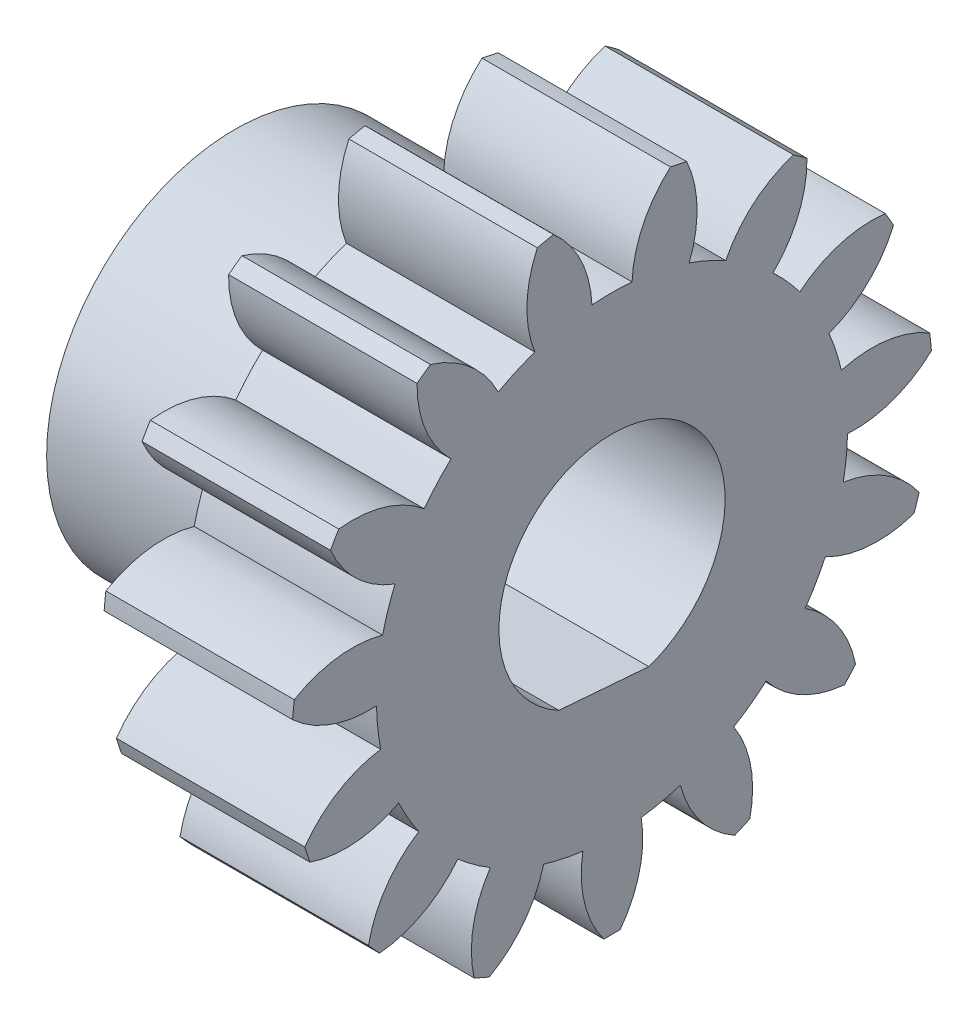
ISO-10303-21;
HEADER;
FILE_DESCRIPTION(('STEP AP214'),'2;1');
FILE_NAME('part.step','',(''),(''),'','','');
FILE_SCHEMA(('AUTOMOTIVE_DESIGN { 1 0 10303 214 1 1 1 1 }'));
ENDSEC;
DATA;
#1=APPLICATION_CONTEXT('core data for automotive mechanical design processes');
#2=APPLICATION_PROTOCOL_DEFINITION('international standard','automotive_design',2000,#1);
#3=PRODUCT_CONTEXT('',#1,'mechanical');
#4=PRODUCT('Part','Part','',(#3));
#5=PRODUCT_RELATED_PRODUCT_CATEGORY('part','',(#4));
#6=PRODUCT_DEFINITION_FORMATION('','',#4);
#7=PRODUCT_DEFINITION_CONTEXT('part definition',#1,'design');
#8=PRODUCT_DEFINITION('design','',#6,#7);
#9=PRODUCT_DEFINITION_SHAPE('','',#8);
#10=(LENGTH_UNIT() NAMED_UNIT(*) SI_UNIT(.MILLI.,.METRE.));
#11=(NAMED_UNIT(*) PLANE_ANGLE_UNIT() SI_UNIT($,.RADIAN.));
#12=(NAMED_UNIT(*) SI_UNIT($,.STERADIAN.) SOLID_ANGLE_UNIT());
#13=UNCERTAINTY_MEASURE_WITH_UNIT(LENGTH_MEASURE(1.E-05),#10,'distance_accuracy_value','');
#14=(GEOMETRIC_REPRESENTATION_CONTEXT(3) GLOBAL_UNCERTAINTY_ASSIGNED_CONTEXT((#13)) GLOBAL_UNIT_ASSIGNED_CONTEXT((#10,
#11,#12)) REPRESENTATION_CONTEXT('',''));
#15=CARTESIAN_POINT('',(0.,0.,0.));
#16=DIRECTION('',(0.,0.,1.));
#17=DIRECTION('',(1.,0.,0.));
#18=AXIS2_PLACEMENT_3D('',#15,#16,#17);
#19=CARTESIAN_POINT('',(5.,0.,0.));
#20=DIRECTION('',(-1.,0.,0.));
#21=DIRECTION('',(0.,0.,1.));
#22=AXIS2_PLACEMENT_3D('',#19,#20,#21);
#23=PLANE('',#22);
#24=DIRECTION('',(0.,0.0792195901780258,0.996857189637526));
#25=VECTOR('',#24,1.);
#26=CARTESIAN_POINT('',(5.,-2.83633822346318,-0.977335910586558));
#27=LINE('',#26,#25);
#28=CARTESIAN_POINT('',(4.9999746,-2.83633822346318,-0.977335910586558));
#29=VERTEX_POINT('',#28);
#30=CARTESIAN_POINT('',(4.9999746,-2.64637631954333,1.41304365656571));
#31=VERTEX_POINT('',#30);
#32=EDGE_CURVE('E445',#29,#31,#27,.T.);
#33=ORIENTED_EDGE('',*,*,#32,.T.);
#34=CARTESIAN_POINT('',(5.,-2.64637631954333,1.41304365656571));
#35=CARTESIAN_POINT('',(5.,-2.40299448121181,1.86885401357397));
#36=CARTESIAN_POINT('',(5.,-2.02075581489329,2.21732855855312));
#37=CARTESIAN_POINT('',(5.,-1.63909344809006,2.56527771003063));
#38=CARTESIAN_POINT('',(5.,-1.16201301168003,2.76581376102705));
#39=CARTESIAN_POINT('',(5.,-0.685900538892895,2.96594293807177));
#40=CARTESIAN_POINT('',(5.,-0.169215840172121,2.99522386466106));
#41=CARTESIAN_POINT('',(5.,0.346420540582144,3.02444538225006));
#42=CARTESIAN_POINT('',(5.,0.843102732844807,2.87909322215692));
#43=CARTESIAN_POINT('',(5.,1.33877719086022,2.73403597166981));
#44=CARTESIAN_POINT('',(5.,1.75815767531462,2.43081911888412));
#45=CARTESIAN_POINT('',(5.,2.17668726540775,2.12821747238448));
#46=CARTESIAN_POINT('',(5.,2.47038466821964,1.7021162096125));
#47=CARTESIAN_POINT('',(5.,2.76348617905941,1.27687947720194));
#48=CARTESIAN_POINT('',(5.,2.89761841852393,0.777050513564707));
#49=CARTESIAN_POINT('',(5.,3.03147851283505,0.278235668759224));
#50=CARTESIAN_POINT('',(5.,2.99057156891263,-0.237658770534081));
#51=CARTESIAN_POINT('',(5.,2.94974762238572,-0.752506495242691));
#52=CARTESIAN_POINT('',(5.,2.73852068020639,-1.22495080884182));
#53=CARTESIAN_POINT('',(5.,2.52772230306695,-1.69643656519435));
#54=CARTESIAN_POINT('',(5.,2.17054332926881,-2.07092772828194));
#55=CARTESIAN_POINT('',(5.,1.81408904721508,-2.44465907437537));
#56=CARTESIAN_POINT('',(5.,1.35216360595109,-2.67799432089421));
#57=CARTESIAN_POINT('',(5.,0.891175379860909,-2.91085614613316));
#58=CARTESIAN_POINT('',(5.,0.377792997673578,-2.9761170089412));
#59=CARTESIAN_POINT('',(5.,-0.134547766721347,-3.04124546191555));
#60=CARTESIAN_POINT('',(5.,-0.640161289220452,-2.93090319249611));
#61=CARTESIAN_POINT('',(5.,-1.1447489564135,-2.82078480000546));
#62=CARTESIAN_POINT('',(5.,-1.58426406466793,-2.54756891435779));
#63=CARTESIAN_POINT('',(5.,-2.02288742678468,-2.27490736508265));
#64=CARTESIAN_POINT('',(5.,-2.34559993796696,-1.87033711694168));
#65=CARTESIAN_POINT('',(5.,-2.66782632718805,-1.46637629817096));
#66=CARTESIAN_POINT('',(5.,-2.83633822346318,-0.977335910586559));
#67=B_SPLINE_CURVE_WITH_KNOTS('',2,(#34,#35,#36,#37,#38,#39,#40,#41,#42,#43,#44,#45,#46,#47,#48,
#49,#50,#51,#52,#53,#54,#55,#56,#57,#58,#59,#60,#61,#62,#63,#64,#65,#66),.UNSPECIFIED.,.F.,.F.,
(3,2,2,2,2,2,2,2,2,2,2,2,2,2,2,2,3),(0.,0.0625,0.125,0.1875,0.25,0.3125,0.375,0.4375,0.5,0.5625,
0.625,0.6875,0.75,0.8125,0.875,0.9375,1.),.UNSPECIFIED.);
#68=EDGE_CURVE('E65',#31,#29,#67,.T.);
#69=ORIENTED_EDGE('',*,*,#68,.T.);
#70=EDGE_LOOP('',(#33,#69));
#71=FACE_BOUND('',#70,.T.);
#72=CARTESIAN_POINT('',(5.,2.87192493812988,6.43599620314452));
#73=DIRECTION('',(-1.,0.,0.));
#74=DIRECTION('',(0.,0.994521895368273,0.104528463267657));
#75=AXIS2_PLACEMENT_3D('',#72,#73,#74);
#76=CIRCLE('',#75,3.);
#77=CARTESIAN_POINT('',(5.,-0.122166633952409,6.24780571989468));
#78=VERTEX_POINT('',#77);
#79=CARTESIAN_POINT('',(5.,0.670023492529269,8.47355111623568));
#80=VERTEX_POINT('',#79);
#81=EDGE_CURVE('E943',#78,#80,#76,.T.);
#82=ORIENTED_EDGE('',*,*,#81,.F.);
#83=CARTESIAN_POINT('',(5.,0.,0.));
#84=DIRECTION('',(-1.,0.,0.));
#85=DIRECTION('',(0.,0.994521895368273,0.104528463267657));
#86=AXIS2_PLACEMENT_3D('',#83,#84,#85);
#87=CIRCLE('',#86,6.249);
#88=CARTESIAN_POINT('',(5.,-1.17949485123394,6.13667604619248));
#89=VERTEX_POINT('',#88);
#90=EDGE_CURVE('E936',#89,#78,#87,.T.);
#91=ORIENTED_EDGE('',*,*,#90,.F.);
#92=CARTESIAN_POINT('',(5.,-4.14728534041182,5.69824747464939));
#93=DIRECTION('',(-1.,0.,0.));
#94=DIRECTION('',(0.,0.994521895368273,0.104528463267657));
#95=AXIS2_PLACEMENT_3D('',#92,#93,#94);
#96=CIRCLE('',#95,3.);
#97=CARTESIAN_POINT('',(5.,-2.41713221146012,8.14907797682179));
#98=VERTEX_POINT('',#97);
#99=EDGE_CURVE('E950',#98,#89,#96,.T.);
#100=ORIENTED_EDGE('',*,*,#99,.F.);
#101=CARTESIAN_POINT('',(5.,0.,0.));
#102=DIRECTION('',(-1.,0.,0.));
#103=DIRECTION('',(0.,0.,1.));
#104=AXIS2_PLACEMENT_3D('',#101,#102,#103);
#105=CIRCLE('',#104,8.5);
#106=CARTESIAN_POINT('',(5.,-2.83440681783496,8.01349723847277));
#107=VERTEX_POINT('',#106);
#108=EDGE_CURVE('E1796',#107,#98,#105,.T.);
#109=ORIENTED_EDGE('',*,*,#108,.F.);
#110=CARTESIAN_POINT('',(5.,0.00587849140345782,7.04769220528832));
#111=DIRECTION('',(-1.,0.,0.));
#112=DIRECTION('',(0.,0.866025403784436,0.500000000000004));
#113=AXIS2_PLACEMENT_3D('',#110,#111,#112);
#114=CIRCLE('',#113,3.);
#115=CARTESIAN_POINT('',(5.,-2.65281629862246,5.65796488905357));
#116=VERTEX_POINT('',#115);
#117=EDGE_CURVE('E843',#116,#107,#114,.T.);
#118=ORIENTED_EDGE('',*,*,#117,.F.);
#119=CARTESIAN_POINT('',(5.,0.,0.));
#120=DIRECTION('',(-1.,0.,0.));
#121=DIRECTION('',(0.,0.866025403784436,0.500000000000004));
#122=AXIS2_PLACEMENT_3D('',#119,#120,#121);
#123=CIRCLE('',#122,6.249);
#124=CARTESIAN_POINT('',(5.,-3.57353317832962,5.12638875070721));
#125=VERTEX_POINT('',#124);
#126=EDGE_CURVE('E838',#125,#116,#123,.T.);
#127=ORIENTED_EDGE('',*,*,#126,.F.);
#128=CARTESIAN_POINT('',(5.,-6.10641973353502,3.51875517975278));
#129=DIRECTION('',(-1.,0.,0.));
#130=DIRECTION('',(0.,0.866025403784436,0.500000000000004));
#131=AXIS2_PLACEMENT_3D('',#128,#129,#130);
#132=CIRCLE('',#131,3.);
#133=CARTESIAN_POINT('',(5.,-5.52268877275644,6.46141692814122));
#134=VERTEX_POINT('',#133);
#135=EDGE_CURVE('E853',#134,#125,#132,.T.);
#136=ORIENTED_EDGE('',*,*,#135,.F.);
#137=CARTESIAN_POINT('',(5.,-5.84874243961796,6.16783688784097));
#138=VERTEX_POINT('',#137);
#139=EDGE_CURVE('E1784',#138,#134,#105,.T.);
#140=ORIENTED_EDGE('',*,*,#139,.F.);
#141=CARTESIAN_POINT('',(5.,-2.86118439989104,6.4407781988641));
#142=DIRECTION('',(-1.,0.,0.));
#143=DIRECTION('',(0.,0.587785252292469,0.80901699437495));
#144=AXIS2_PLACEMENT_3D('',#141,#142,#143);
#145=CIRCLE('',#144,3.);
#146=CARTESIAN_POINT('',(5.,-4.7247699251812,4.08981052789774));
#147=VERTEX_POINT('',#146);
#148=EDGE_CURVE('E869',#147,#138,#145,.T.);
#149=ORIENTED_EDGE('',*,*,#148,.F.);
#150=CARTESIAN_POINT('',(5.,0.,0.));
#151=DIRECTION('',(-1.,0.,0.));
#152=DIRECTION('',(0.,0.587785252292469,0.80901699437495));
#153=AXIS2_PLACEMENT_3D('',#150,#151,#152);
#154=CIRCLE('',#153,6.249);
#155=CARTESIAN_POINT('',(5.,-5.34967515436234,3.22970226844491));
#156=VERTEX_POINT('',#155);
#157=EDGE_CURVE('E861',#156,#147,#154,.T.);
#158=ORIENTED_EDGE('',*,*,#157,.F.);
#159=CARTESIAN_POINT('',(5.,-7.00969867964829,0.730838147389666));
#160=DIRECTION('',(-1.,0.,0.));
#161=DIRECTION('',(0.,0.587785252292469,0.80901699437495));
#162=AXIS2_PLACEMENT_3D('',#159,#160,#161);
#163=CIRCLE('',#162,3.);
#164=CARTESIAN_POINT('',(5.,-7.67332227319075,3.65651819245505));
#165=VERTEX_POINT('',#164);
#166=EDGE_CURVE('E877',#165,#156,#163,.T.);
#167=ORIENTED_EDGE('',*,*,#166,.F.);
#168=CARTESIAN_POINT('',(5.,-7.85177735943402,3.25570150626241));
#169=VERTEX_POINT('',#168);
#170=EDGE_CURVE('E1771',#169,#165,#105,.T.);
#171=ORIENTED_EDGE('',*,*,#170,.F.);
#172=CARTESIAN_POINT('',(5.,-5.23352251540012,4.72019512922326));
#173=DIRECTION('',(-1.,0.,0.));
#174=DIRECTION('',(0.,0.207911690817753,0.978147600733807));
#175=AXIS2_PLACEMENT_3D('',#172,#173,#174);
#176=CIRCLE('',#175,3.);
#177=CARTESIAN_POINT('',(5.,-5.97976790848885,1.81449077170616));
#178=VERTEX_POINT('',#177);
#179=EDGE_CURVE('E893',#178,#169,#176,.T.);
#180=ORIENTED_EDGE('',*,*,#179,.F.);
#181=CARTESIAN_POINT('',(5.,0.,0.));
#182=DIRECTION('',(-1.,0.,0.));
#183=DIRECTION('',(0.,0.207911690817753,0.978147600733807));
#184=AXIS2_PLACEMENT_3D('',#181,#182,#183);
#185=CIRCLE('',#184,6.249);
#186=CARTESIAN_POINT('',(5.,-6.20080969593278,0.774570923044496));
#187=VERTEX_POINT('',#186);
#188=EDGE_CURVE('E888',#187,#178,#185,.T.);
#189=ORIENTED_EDGE('',*,*,#188,.F.);
#190=CARTESIAN_POINT('',(5.,-6.70093704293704,-2.18344744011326));
#191=DIRECTION('',(-1.,0.,0.));
#192=DIRECTION('',(0.,0.207911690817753,0.978147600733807));
#193=AXIS2_PLACEMENT_3D('',#190,#191,#192);
#194=CIRCLE('',#193,3.);
#195=CARTESIAN_POINT('',(5.,-8.49716864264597,0.219374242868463));
#196=VERTEX_POINT('',#195);
#197=EDGE_CURVE('E898',#196,#187,#194,.T.);
#198=ORIENTED_EDGE('',*,*,#197,.F.);
#199=CARTESIAN_POINT('',(5.,-8.49716864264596,-0.219374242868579));
#200=VERTEX_POINT('',#199);
#201=EDGE_CURVE('E1763',#200,#196,#105,.T.);
#202=ORIENTED_EDGE('',*,*,#201,.F.);
#203=CARTESIAN_POINT('',(5.,-6.70093704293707,2.18344744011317));
#204=DIRECTION('',(-1.,0.,0.));
#205=DIRECTION('',(0.,-0.207911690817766,0.978147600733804));
#206=AXIS2_PLACEMENT_3D('',#203,#204,#205);
#207=CIRCLE('',#206,3.);
#208=CARTESIAN_POINT('',(5.,-6.20080969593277,-0.774570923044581));
#209=VERTEX_POINT('',#208);
#210=EDGE_CURVE('E774',#209,#200,#207,.T.);
#211=ORIENTED_EDGE('',*,*,#210,.F.);
#212=CARTESIAN_POINT('',(5.,0.,0.));
#213=DIRECTION('',(-1.,0.,0.));
#214=DIRECTION('',(0.,-0.207911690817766,0.978147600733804));
#215=AXIS2_PLACEMENT_3D('',#212,#213,#214);
#216=CIRCLE('',#215,6.249);
#217=CARTESIAN_POINT('',(5.,-5.97976790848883,-1.81449077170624));
#218=VERTEX_POINT('',#217);
#219=EDGE_CURVE('E767',#218,#209,#216,.T.);
#220=ORIENTED_EDGE('',*,*,#219,.F.);
#221=CARTESIAN_POINT('',(5.,-5.23352251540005,-4.72019512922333));
#222=DIRECTION('',(-1.,0.,0.));
#223=DIRECTION('',(0.,-0.207911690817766,0.978147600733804));
#224=AXIS2_PLACEMENT_3D('',#221,#222,#223);
#225=CIRCLE('',#224,3.);
#226=CARTESIAN_POINT('',(5.,-7.85177735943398,-3.25570150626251));
#227=VERTEX_POINT('',#226);
#228=EDGE_CURVE('E783',#227,#218,#225,.T.);
#229=ORIENTED_EDGE('',*,*,#228,.F.);
#230=CARTESIAN_POINT('',(5.,-7.6733222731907,-3.65651819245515));
#231=VERTEX_POINT('',#230);
#232=EDGE_CURVE('E1754',#231,#227,#105,.T.);
#233=ORIENTED_EDGE('',*,*,#232,.F.);
#234=CARTESIAN_POINT('',(5.,-7.00969867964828,-0.73083814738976));
#235=DIRECTION('',(-1.,0.,0.));
#236=DIRECTION('',(0.,-0.58778525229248,0.809016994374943));
#237=AXIS2_PLACEMENT_3D('',#234,#235,#236);
#238=CIRCLE('',#237,3.);
#239=CARTESIAN_POINT('',(5.,-5.3496751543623,-3.22970226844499));
#240=VERTEX_POINT('',#239);
#241=EDGE_CURVE('E799',#240,#231,#238,.T.);
#242=ORIENTED_EDGE('',*,*,#241,.F.);
#243=CARTESIAN_POINT('',(5.,0.,0.));
#244=DIRECTION('',(-1.,0.,0.));
#245=DIRECTION('',(0.,-0.58778525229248,0.809016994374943));
#246=AXIS2_PLACEMENT_3D('',#243,#244,#245);
#247=CIRCLE('',#246,6.249);
#248=CARTESIAN_POINT('',(5.,-4.72476992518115,-4.08981052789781));
#249=VERTEX_POINT('',#248);
#250=EDGE_CURVE('E795',#249,#240,#247,.T.);
#251=ORIENTED_EDGE('',*,*,#250,.F.);
#252=CARTESIAN_POINT('',(5.,-2.86118439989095,-6.44077819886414));
#253=DIRECTION('',(-1.,0.,0.));
#254=DIRECTION('',(0.,-0.58778525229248,0.809016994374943));
#255=AXIS2_PLACEMENT_3D('',#252,#253,#254);
#256=CIRCLE('',#255,3.);
#257=CARTESIAN_POINT('',(5.,-5.84874243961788,-6.16783688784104));
#258=VERTEX_POINT('',#257);
#259=EDGE_CURVE('E802',#258,#249,#256,.T.);
#260=ORIENTED_EDGE('',*,*,#259,.F.);
#261=CARTESIAN_POINT('',(5.,-5.52268877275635,-6.4614169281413));
#262=VERTEX_POINT('',#261);
#263=EDGE_CURVE('E1741',#262,#258,#105,.T.);
#264=ORIENTED_EDGE('',*,*,#263,.F.);
#265=CARTESIAN_POINT('',(5.,-6.10641973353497,-3.51875517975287));
#266=DIRECTION('',(-1.,0.,0.));
#267=DIRECTION('',(0.,-0.866025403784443,0.499999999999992));
#268=AXIS2_PLACEMENT_3D('',#265,#266,#267);
#269=CIRCLE('',#268,3.);
#270=CARTESIAN_POINT('',(5.,-3.57353317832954,-5.12638875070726));
#271=VERTEX_POINT('',#270);
#272=EDGE_CURVE('E821',#271,#262,#269,.T.);
#273=ORIENTED_EDGE('',*,*,#272,.F.);
#274=CARTESIAN_POINT('',(5.,0.,0.));
#275=DIRECTION('',(-1.,0.,0.));
#276=DIRECTION('',(0.,-0.866025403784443,0.499999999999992));
#277=AXIS2_PLACEMENT_3D('',#274,#275,#276);
#278=CIRCLE('',#277,6.249);
#279=CARTESIAN_POINT('',(5.,-2.65281629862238,-5.65796488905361));
#280=VERTEX_POINT('',#279);
#281=EDGE_CURVE('E818',#280,#271,#278,.T.);
#282=ORIENTED_EDGE('',*,*,#281,.F.);
#283=CARTESIAN_POINT('',(5.,0.00587849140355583,-7.04769220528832));
#284=DIRECTION('',(-1.,0.,0.));
#285=DIRECTION('',(0.,-0.866025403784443,0.499999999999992));
#286=AXIS2_PLACEMENT_3D('',#283,#284,#285);
#287=CIRCLE('',#286,3.);
#288=CARTESIAN_POINT('',(5.,-2.83440681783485,-8.01349723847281));
#289=VERTEX_POINT('',#288);
#290=EDGE_CURVE('E830',#289,#280,#287,.T.);
#291=ORIENTED_EDGE('',*,*,#290,.F.);
#292=CARTESIAN_POINT('',(5.,-2.41713221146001,-8.14907797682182));
#293=VERTEX_POINT('',#292);
#294=EDGE_CURVE('E1727',#293,#289,#105,.T.);
#295=ORIENTED_EDGE('',*,*,#294,.F.);
#296=CARTESIAN_POINT('',(5.,-4.14728534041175,-5.69824747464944));
#297=DIRECTION('',(-1.,0.,0.));
#298=DIRECTION('',(0.,-0.994521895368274,0.104528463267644));
#299=AXIS2_PLACEMENT_3D('',#296,#297,#298);
#300=CIRCLE('',#299,3.);
#301=CARTESIAN_POINT('',(5.,-1.17949485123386,-6.1366760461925));
#302=VERTEX_POINT('',#301);
#303=EDGE_CURVE('E701',#302,#293,#300,.T.);
#304=ORIENTED_EDGE('',*,*,#303,.F.);
#305=CARTESIAN_POINT('',(5.,0.,0.));
#306=DIRECTION('',(-1.,0.,0.));
#307=DIRECTION('',(0.,-0.994521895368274,0.104528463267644));
#308=AXIS2_PLACEMENT_3D('',#305,#306,#307);
#309=CIRCLE('',#308,6.249);
#310=CARTESIAN_POINT('',(5.,-0.122166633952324,-6.24780571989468));
#311=VERTEX_POINT('',#310);
#312=EDGE_CURVE('E696',#311,#302,#309,.T.);
#313=ORIENTED_EDGE('',*,*,#312,.F.);
#314=CARTESIAN_POINT('',(5.,2.87192493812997,-6.43599620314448));
#315=DIRECTION('',(-1.,0.,0.));
#316=DIRECTION('',(0.,-0.994521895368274,0.104528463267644));
#317=AXIS2_PLACEMENT_3D('',#314,#315,#316);
#318=CIRCLE('',#317,3.);
#319=CARTESIAN_POINT('',(5.,0.670023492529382,-8.47355111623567));
#320=VERTEX_POINT('',#319);
#321=EDGE_CURVE('E710',#320,#311,#318,.T.);
#322=ORIENTED_EDGE('',*,*,#321,.F.);
#323=CARTESIAN_POINT('',(5.,1.10636846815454,-8.42768941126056));
#324=VERTEX_POINT('',#323);
#325=EDGE_CURVE('E1718',#324,#320,#105,.T.);
#326=ORIENTED_EDGE('',*,*,#325,.F.);
#327=CARTESIAN_POINT('',(5.,-1.47104763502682,-6.89246101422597));
#328=DIRECTION('',(-1.,0.,0.));
#329=DIRECTION('',(0.,-0.95105651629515,-0.309016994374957));
#330=AXIS2_PLACEMENT_3D('',#327,#328,#329);
#331=CIRCLE('',#330,3.);
#332=CARTESIAN_POINT('',(5.,1.41848885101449,-6.08587630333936));
#333=VERTEX_POINT('',#332);
#334=EDGE_CURVE('E672',#333,#324,#331,.T.);
#335=ORIENTED_EDGE('',*,*,#334,.F.);
#336=CARTESIAN_POINT('',(5.,0.,0.));
#337=DIRECTION('',(-1.,0.,0.));
#338=DIRECTION('',(0.,-0.95105651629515,-0.309016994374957));
#339=AXIS2_PLACEMENT_3D('',#336,#337,#338);
#340=CIRCLE('',#339,6.249);
#341=CARTESIAN_POINT('',(5.,2.42960675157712,-5.75734418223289));
#342=VERTEX_POINT('',#341);
#343=EDGE_CURVE('E668',#342,#333,#340,.T.);
#344=ORIENTED_EDGE('',*,*,#343,.F.);
#345=CARTESIAN_POINT('',(5.,5.24138947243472,-4.711457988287));
#346=DIRECTION('',(-1.,0.,0.));
#347=DIRECTION('',(0.,-0.95105651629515,-0.309016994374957));
#348=AXIS2_PLACEMENT_3D('',#345,#346,#347);
#349=CIRCLE('',#348,3.);
#350=CARTESIAN_POINT('',(5.,4.05860065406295,-7.46845102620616));
#351=VERTEX_POINT('',#350);
#352=EDGE_CURVE('E681',#351,#342,#349,.T.);
#353=ORIENTED_EDGE('',*,*,#352,.F.);
#354=CARTESIAN_POINT('',(5.,4.43856798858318,-7.24907678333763));
#355=VERTEX_POINT('',#354);
#356=EDGE_CURVE('E1839',#355,#351,#105,.T.);
#357=ORIENTED_EDGE('',*,*,#356,.F.);
#358=CARTESIAN_POINT('',(5.,1.45954757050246,-6.89490542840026));
#359=DIRECTION('',(-1.,0.,0.));
#360=DIRECTION('',(0.,-0.743144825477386,-0.669130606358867));
#361=AXIS2_PLACEMENT_3D('',#358,#359,#360);
#362=CIRCLE('',#361,3.);
#363=CARTESIAN_POINT('',(5.,3.77120294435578,-4.98277325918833));
#364=VERTEX_POINT('',#363);
#365=EDGE_CURVE('E723',#364,#355,#362,.T.);
#366=ORIENTED_EDGE('',*,*,#365,.F.);
#367=CARTESIAN_POINT('',(5.,0.,0.));
#368=DIRECTION('',(-1.,0.,0.));
#369=DIRECTION('',(0.,-0.743144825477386,-0.669130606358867));
#370=AXIS2_PLACEMENT_3D('',#367,#368,#369);
#371=CIRCLE('',#370,6.249);
#372=CARTESIAN_POINT('',(5.,4.56127905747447,-4.27138553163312));
#373=VERTEX_POINT('',#372);
#374=EDGE_CURVE('E716',#373,#364,#371,.T.);
#375=ORIENTED_EDGE('',*,*,#374,.F.);
#376=CARTESIAN_POINT('',(5.,6.70457015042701,-2.17226588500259));
#377=DIRECTION('',(-1.,0.,0.));
#378=DIRECTION('',(0.,-0.743144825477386,-0.669130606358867));
#379=AXIS2_PLACEMENT_3D('',#376,#377,#378);
#380=CIRCLE('',#379,3.);
#381=CARTESIAN_POINT('',(5.,6.74540889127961,-5.17198790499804));
#382=VERTEX_POINT('',#381);
#383=EDGE_CURVE('E732',#382,#373,#380,.T.);
#384=ORIENTED_EDGE('',*,*,#383,.F.);
#385=CARTESIAN_POINT('',(5.,7.00329878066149,-4.8170329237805));
#386=VERTEX_POINT('',#385);
#387=EDGE_CURVE('E512',#386,#382,#105,.T.);
#388=ORIENTED_EDGE('',*,*,#387,.F.);
#389=CARTESIAN_POINT('',(5.,4.13777374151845,-5.70515805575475));
#390=DIRECTION('',(-1.,0.,0.));
#391=DIRECTION('',(0.,-0.406736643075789,-0.913545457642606));
#392=AXIS2_PLACEMENT_3D('',#389,#390,#391);
#393=CIRCLE('',#392,3.);
#394=CARTESIAN_POINT('',(5.,5.47184178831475,-3.01810345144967));
#395=VERTEX_POINT('',#394);
#396=EDGE_CURVE('E747',#395,#386,#393,.T.);
#397=ORIENTED_EDGE('',*,*,#396,.F.);
#398=CARTESIAN_POINT('',(5.,0.,0.));
#399=DIRECTION('',(-1.,0.,0.));
#400=DIRECTION('',(0.,-0.406736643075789,-0.913545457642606));
#401=AXIS2_PLACEMENT_3D('',#398,#399,#400);
#402=CIRCLE('',#401,6.249);
#403=CARTESIAN_POINT('',(5.,5.90426477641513,-2.04686551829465));
#404=VERTEX_POINT('',#403);
#405=EDGE_CURVE('E745',#404,#395,#402,.T.);
#406=ORIENTED_EDGE('',*,*,#405,.F.);
#407=CARTESIAN_POINT('',(5.,7.0084697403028,0.742530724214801));
#408=DIRECTION('',(-1.,0.,0.));
#409=DIRECTION('',(0.,-0.406736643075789,-0.913545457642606));
#410=AXIS2_PLACEMENT_3D('',#407,#408,#409);
#411=CIRCLE('',#410,3.);
#412=CARTESIAN_POINT('',(5.,8.26587465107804,-1.9812410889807));
#413=VERTEX_POINT('',#412);
#414=EDGE_CURVE('E752',#413,#404,#411,.T.);
#415=ORIENTED_EDGE('',*,*,#414,.F.);
#416=CARTESIAN_POINT('',(5.,8.35709559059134,-1.55208031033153));
#417=VERTEX_POINT('',#416);
#418=EDGE_CURVE('E510',#417,#413,#105,.T.);
#419=ORIENTED_EDGE('',*,*,#418,.F.);
#420=CARTESIAN_POINT('',(5.,6.10054124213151,-3.52893702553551));
#421=DIRECTION('',(-1.,0.,0.));
#422=DIRECTION('',(0.,0.,-1.));
#423=AXIS2_PLACEMENT_3D('',#420,#421,#422);
#424=CIRCLE('',#423,3.);
#425=CARTESIAN_POINT('',(5.,6.22634947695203,-0.531576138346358));
#426=VERTEX_POINT('',#425);
#427=EDGE_CURVE('E538',#426,#417,#424,.T.);
#428=ORIENTED_EDGE('',*,*,#427,.F.);
#429=CARTESIAN_POINT('',(5.,0.,0.));
#430=DIRECTION('',(-1.,0.,0.));
#431=DIRECTION('',(0.,0.,-1.));
#432=AXIS2_PLACEMENT_3D('',#429,#430,#431);
#433=CIRCLE('',#432,6.249);
#434=CARTESIAN_POINT('',(5.,6.22634947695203,0.531576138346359));
#435=VERTEX_POINT('',#434);
#436=EDGE_CURVE('E533',#435,#426,#433,.T.);
#437=ORIENTED_EDGE('',*,*,#436,.F.);
#438=CARTESIAN_POINT('',(5.,6.10054124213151,3.52893702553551));
#439=DIRECTION('',(-1.,0.,0.));
#440=DIRECTION('',(0.,0.,-1.));
#441=AXIS2_PLACEMENT_3D('',#438,#439,#440);
#442=CIRCLE('',#441,3.);
#443=CARTESIAN_POINT('',(5.,8.35709559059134,1.55208031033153));
#444=VERTEX_POINT('',#443);
#445=EDGE_CURVE('E548',#444,#435,#442,.T.);
#446=ORIENTED_EDGE('',*,*,#445,.F.);
#447=CARTESIAN_POINT('',(5.,8.26587465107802,1.98124108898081));
#448=VERTEX_POINT('',#447);
#449=EDGE_CURVE('E514',#448,#444,#105,.T.);
#450=ORIENTED_EDGE('',*,*,#449,.F.);
#451=CARTESIAN_POINT('',(5.,7.00846974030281,-0.742530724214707));
#452=DIRECTION('',(-1.,0.,0.));
#453=DIRECTION('',(0.,0.406736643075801,-0.913545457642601));
#454=AXIS2_PLACEMENT_3D('',#451,#452,#453);
#455=CIRCLE('',#454,3.);
#456=CARTESIAN_POINT('',(5.,5.9042647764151,2.04686551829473));
#457=VERTEX_POINT('',#456);
#458=EDGE_CURVE('E571',#457,#448,#455,.T.);
#459=ORIENTED_EDGE('',*,*,#458,.F.);
#460=CARTESIAN_POINT('',(5.,0.,0.));
#461=DIRECTION('',(-1.,0.,0.));
#462=DIRECTION('',(0.,0.406736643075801,-0.913545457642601));
#463=AXIS2_PLACEMENT_3D('',#460,#461,#462);
#464=CIRCLE('',#463,6.249);
#465=CARTESIAN_POINT('',(5.,5.47184178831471,3.01810345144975));
#466=VERTEX_POINT('',#465);
#467=EDGE_CURVE('E566',#466,#457,#464,.T.);
#468=ORIENTED_EDGE('',*,*,#467,.F.);
#469=CARTESIAN_POINT('',(5.,4.13777374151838,5.70515805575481));
#470=DIRECTION('',(-1.,0.,0.));
#471=DIRECTION('',(0.,0.406736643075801,-0.913545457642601));
#472=AXIS2_PLACEMENT_3D('',#469,#470,#471);
#473=CIRCLE('',#472,3.);
#474=CARTESIAN_POINT('',(5.,7.00329878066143,4.81703292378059));
#475=VERTEX_POINT('',#474);
#476=EDGE_CURVE('E576',#475,#466,#473,.T.);
#477=ORIENTED_EDGE('',*,*,#476,.F.);
#478=CARTESIAN_POINT('',(5.,6.74540889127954,5.17198790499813));
#479=VERTEX_POINT('',#478);
#480=EDGE_CURVE('E515',#479,#475,#105,.T.);
#481=ORIENTED_EDGE('',*,*,#480,.F.);
#482=CARTESIAN_POINT('',(5.,6.70457015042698,2.17226588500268));
#483=DIRECTION('',(-1.,0.,0.));
#484=DIRECTION('',(0.,0.743144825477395,-0.669130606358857));
#485=AXIS2_PLACEMENT_3D('',#482,#483,#484);
#486=CIRCLE('',#485,3.);
#487=CARTESIAN_POINT('',(5.,4.56127905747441,4.27138553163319));
#488=VERTEX_POINT('',#487);
#489=EDGE_CURVE('E912',#488,#479,#486,.T.);
#490=ORIENTED_EDGE('',*,*,#489,.F.);
#491=CARTESIAN_POINT('',(5.,0.,0.));
#492=DIRECTION('',(-1.,0.,0.));
#493=DIRECTION('',(0.,0.743144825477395,-0.669130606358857));
#494=AXIS2_PLACEMENT_3D('',#491,#492,#493);
#495=CIRCLE('',#494,6.249);
#496=CARTESIAN_POINT('',(5.,3.77120294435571,4.98277325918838));
#497=VERTEX_POINT('',#496);
#498=EDGE_CURVE('E908',#497,#488,#495,.T.);
#499=ORIENTED_EDGE('',*,*,#498,.F.);
#500=CARTESIAN_POINT('',(5.,1.45954757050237,6.89490542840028));
#501=DIRECTION('',(-1.,0.,0.));
#502=DIRECTION('',(0.,0.743144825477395,-0.669130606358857));
#503=AXIS2_PLACEMENT_3D('',#500,#501,#502);
#504=CIRCLE('',#503,3.);
#505=CARTESIAN_POINT('',(5.,4.43856798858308,7.24907678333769));
#506=VERTEX_POINT('',#505);
#507=EDGE_CURVE('E921',#506,#497,#504,.T.);
#508=ORIENTED_EDGE('',*,*,#507,.F.);
#509=CARTESIAN_POINT('',(5.,4.05860065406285,7.46845102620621));
#510=VERTEX_POINT('',#509);
#511=EDGE_CURVE('E1819',#510,#506,#105,.T.);
#512=ORIENTED_EDGE('',*,*,#511,.F.);
#513=CARTESIAN_POINT('',(5.,5.24138947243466,4.71145798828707));
#514=DIRECTION('',(-1.,0.,0.));
#515=DIRECTION('',(0.,0.951056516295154,-0.309016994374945));
#516=AXIS2_PLACEMENT_3D('',#513,#514,#515);
#517=CIRCLE('',#516,3.);
#518=CARTESIAN_POINT('',(5.,2.42960675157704,5.75734418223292));
#519=VERTEX_POINT('',#518);
#520=EDGE_CURVE('E962',#519,#510,#517,.T.);
#521=ORIENTED_EDGE('',*,*,#520,.F.);
#522=CARTESIAN_POINT('',(5.,0.,0.));
#523=DIRECTION('',(-1.,0.,0.));
#524=DIRECTION('',(0.,0.951056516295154,-0.309016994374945));
#525=AXIS2_PLACEMENT_3D('',#522,#523,#524);
#526=CIRCLE('',#525,6.249);
#527=CARTESIAN_POINT('',(5.,1.41848885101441,6.08587630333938));
#528=VERTEX_POINT('',#527);
#529=EDGE_CURVE('E958',#528,#519,#526,.T.);
#530=ORIENTED_EDGE('',*,*,#529,.F.);
#531=CARTESIAN_POINT('',(5.,-1.47104763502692,6.89246101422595));
#532=DIRECTION('',(-1.,0.,0.));
#533=DIRECTION('',(0.,0.951056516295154,-0.309016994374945));
#534=AXIS2_PLACEMENT_3D('',#531,#532,#533);
#535=CIRCLE('',#534,3.);
#536=CARTESIAN_POINT('',(5.,1.10636846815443,8.42768941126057));
#537=VERTEX_POINT('',#536);
#538=EDGE_CURVE('E966',#537,#528,#535,.T.);
#539=ORIENTED_EDGE('',*,*,#538,.F.);
#540=EDGE_CURVE('E1806',#80,#537,#105,.T.);
#541=ORIENTED_EDGE('',*,*,#540,.F.);
#542=EDGE_LOOP('',(#82,#91,#100,#109,#118,#127,#136,#140,#149,#158,#167,#171,#180,#189,#198,
#202,#211,#220,#229,#233,#242,#251,#260,#264,#273,#282,#291,#295,#304,#313,#322,#326,#335,#344,
#353,#357,#366,#375,#384,#388,#397,#406,#415,#419,#428,#437,#446,#450,#459,#468,#477,#481,#490,
#499,#508,#512,#521,#530,#539,#541));
#543=FACE_BOUND('',#542,.T.);
#544=ADVANCED_FACE('F44',(#71,#543),#23,.F.);
#545=CARTESIAN_POINT('',(-10.,0.,0.));
#546=DIRECTION('',(-1.,0.,0.));
#547=DIRECTION('',(0.,0.,1.));
#548=AXIS2_PLACEMENT_3D('',#545,#546,#547);
#549=CYLINDRICAL_SURFACE('',#548,8.5);
#550=DIRECTION('',(-1.,0.,0.));
#551=VECTOR('',#550,1.);
#552=CARTESIAN_POINT('',(2.5,0.67002349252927,8.47355111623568));
#553=LINE('',#552,#551);
#554=CARTESIAN_POINT('',(0.,0.67002349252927,8.47355111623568));
#555=VERTEX_POINT('',#554);
#556=EDGE_CURVE('E577',#80,#555,#553,.T.);
#557=ORIENTED_EDGE('',*,*,#556,.F.);
#558=ORIENTED_EDGE('',*,*,#540,.T.);
#559=DIRECTION('',(-1.,0.,0.));
#560=VECTOR('',#559,1.);
#561=CARTESIAN_POINT('',(2.5,1.10636846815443,8.42768941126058));
#562=LINE('',#561,#560);
#563=CARTESIAN_POINT('',(0.,1.10636846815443,8.42768941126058));
#564=VERTEX_POINT('',#563);
#565=EDGE_CURVE('E595',#564,#537,#562,.F.);
#566=ORIENTED_EDGE('',*,*,#565,.F.);
#567=CARTESIAN_POINT('',(0.,0.,0.));
#568=DIRECTION('',(-1.,0.,0.));
#569=DIRECTION('',(0.,0.,1.));
#570=AXIS2_PLACEMENT_3D('',#567,#568,#569);
#571=CIRCLE('',#570,8.5);
#572=EDGE_CURVE('E1668',#555,#564,#571,.T.);
#573=ORIENTED_EDGE('',*,*,#572,.F.);
#574=EDGE_LOOP('',(#557,#558,#566,#573));
#575=FACE_BOUND('',#574,.T.);
#576=ADVANCED_FACE('F1193',(#575),#549,.T.);
#577=DIRECTION('',(-1.,0.,0.));
#578=VECTOR('',#577,1.);
#579=CARTESIAN_POINT('',(2.5,-2.41713221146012,8.14907797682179));
#580=LINE('',#579,#578);
#581=CARTESIAN_POINT('',(0.,-2.41713221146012,8.14907797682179));
#582=VERTEX_POINT('',#581);
#583=EDGE_CURVE('E588',#582,#98,#580,.F.);
#584=ORIENTED_EDGE('',*,*,#583,.F.);
#585=CARTESIAN_POINT('',(0.,-2.83440681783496,8.01349723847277));
#586=VERTEX_POINT('',#585);
#587=EDGE_CURVE('E1673',#586,#582,#571,.T.);
#588=ORIENTED_EDGE('',*,*,#587,.F.);
#589=DIRECTION('',(-1.,0.,0.));
#590=VECTOR('',#589,1.);
#591=CARTESIAN_POINT('',(2.5,-2.83440681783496,8.01349723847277));
#592=LINE('',#591,#590);
#593=EDGE_CURVE('E613',#107,#586,#592,.T.);
#594=ORIENTED_EDGE('',*,*,#593,.F.);
#595=ORIENTED_EDGE('',*,*,#108,.T.);
#596=EDGE_LOOP('',(#584,#588,#594,#595));
#597=FACE_BOUND('',#596,.T.);
#598=ADVANCED_FACE('F1200',(#597),#549,.T.);
#599=DIRECTION('',(-1.,0.,0.));
#600=VECTOR('',#599,1.);
#601=CARTESIAN_POINT('',(2.5,4.05860065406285,7.46845102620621));
#602=LINE('',#601,#600);
#603=CARTESIAN_POINT('',(0.,4.05860065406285,7.46845102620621));
#604=VERTEX_POINT('',#603);
#605=EDGE_CURVE('E589',#510,#604,#602,.T.);
#606=ORIENTED_EDGE('',*,*,#605,.F.);
#607=ORIENTED_EDGE('',*,*,#511,.T.);
#608=DIRECTION('',(-1.,0.,0.));
#609=VECTOR('',#608,1.);
#610=CARTESIAN_POINT('',(2.5,4.43856798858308,7.24907678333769));
#611=LINE('',#610,#609);
#612=CARTESIAN_POINT('',(0.,4.43856798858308,7.24907678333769));
#613=VERTEX_POINT('',#612);
#614=EDGE_CURVE('E596',#613,#506,#611,.F.);
#615=ORIENTED_EDGE('',*,*,#614,.F.);
#616=EDGE_CURVE('E1661',#604,#613,#571,.T.);
#617=ORIENTED_EDGE('',*,*,#616,.F.);
#618=EDGE_LOOP('',(#606,#607,#615,#617));
#619=FACE_BOUND('',#618,.T.);
#620=ADVANCED_FACE('F1456',(#619),#549,.T.);
#621=DIRECTION('',(-1.,0.,0.));
#622=VECTOR('',#621,1.);
#623=CARTESIAN_POINT('',(2.5,6.74540889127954,5.17198790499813));
#624=LINE('',#623,#622);
#625=CARTESIAN_POINT('',(0.,6.74540889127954,5.17198790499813));
#626=VERTEX_POINT('',#625);
#627=EDGE_CURVE('E594',#479,#626,#624,.T.);
#628=ORIENTED_EDGE('',*,*,#627,.F.);
#629=ORIENTED_EDGE('',*,*,#480,.T.);
#630=DIRECTION('',(-1.,0.,0.));
#631=VECTOR('',#630,1.);
#632=CARTESIAN_POINT('',(2.5,7.00329878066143,4.81703292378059));
#633=LINE('',#632,#631);
#634=CARTESIAN_POINT('',(0.,7.00329878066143,4.81703292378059));
#635=VERTEX_POINT('',#634);
#636=EDGE_CURVE('E554',#635,#475,#633,.F.);
#637=ORIENTED_EDGE('',*,*,#636,.F.);
#638=EDGE_CURVE('E516',#626,#635,#571,.T.);
#639=ORIENTED_EDGE('',*,*,#638,.F.);
#640=EDGE_LOOP('',(#628,#629,#637,#639));
#641=FACE_BOUND('',#640,.T.);
#642=ADVANCED_FACE('F1464',(#641),#549,.T.);
#643=DIRECTION('',(-1.,0.,0.));
#644=VECTOR('',#643,1.);
#645=CARTESIAN_POINT('',(2.5,-5.84874243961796,6.16783688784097));
#646=LINE('',#645,#644);
#647=CARTESIAN_POINT('',(0.,-5.84874243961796,6.16783688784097));
#648=VERTEX_POINT('',#647);
#649=EDGE_CURVE('E602',#138,#648,#646,.T.);
#650=ORIENTED_EDGE('',*,*,#649,.F.);
#651=ORIENTED_EDGE('',*,*,#139,.T.);
#652=DIRECTION('',(-1.,0.,0.));
#653=VECTOR('',#652,1.);
#654=CARTESIAN_POINT('',(2.5,-5.52268877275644,6.46141692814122));
#655=LINE('',#654,#653);
#656=CARTESIAN_POINT('',(0.,-5.52268877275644,6.46141692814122));
#657=VERTEX_POINT('',#656);
#658=EDGE_CURVE('E618',#657,#134,#655,.F.);
#659=ORIENTED_EDGE('',*,*,#658,.F.);
#660=EDGE_CURVE('E1677',#648,#657,#571,.T.);
#661=ORIENTED_EDGE('',*,*,#660,.F.);
#662=EDGE_LOOP('',(#650,#651,#659,#661));
#663=FACE_BOUND('',#662,.T.);
#664=ADVANCED_FACE('F1473',(#663),#549,.T.);
#665=DIRECTION('',(-1.,0.,0.));
#666=VECTOR('',#665,1.);
#667=CARTESIAN_POINT('',(2.5,-7.67332227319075,3.65651819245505));
#668=LINE('',#667,#666);
#669=CARTESIAN_POINT('',(0.,-7.67332227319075,3.65651819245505));
#670=VERTEX_POINT('',#669);
#671=EDGE_CURVE('E601',#670,#165,#668,.F.);
#672=ORIENTED_EDGE('',*,*,#671,.F.);
#673=CARTESIAN_POINT('',(0.,-7.85177735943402,3.25570150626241));
#674=VERTEX_POINT('',#673);
#675=EDGE_CURVE('E1684',#674,#670,#571,.T.);
#676=ORIENTED_EDGE('',*,*,#675,.F.);
#677=DIRECTION('',(-1.,0.,0.));
#678=VECTOR('',#677,1.);
#679=CARTESIAN_POINT('',(2.5,-7.85177735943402,3.25570150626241));
#680=LINE('',#679,#678);
#681=EDGE_CURVE('E610',#169,#674,#680,.T.);
#682=ORIENTED_EDGE('',*,*,#681,.F.);
#683=ORIENTED_EDGE('',*,*,#170,.T.);
#684=EDGE_LOOP('',(#672,#676,#682,#683));
#685=FACE_BOUND('',#684,.T.);
#686=ADVANCED_FACE('F1485',(#685),#549,.T.);
#687=DIRECTION('',(-1.,0.,0.));
#688=VECTOR('',#687,1.);
#689=CARTESIAN_POINT('',(2.5,-8.49716864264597,0.219374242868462));
#690=LINE('',#689,#688);
#691=CARTESIAN_POINT('',(0.,-8.49716864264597,0.219374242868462));
#692=VERTEX_POINT('',#691);
#693=EDGE_CURVE('E607',#692,#196,#690,.F.);
#694=ORIENTED_EDGE('',*,*,#693,.F.);
#695=CARTESIAN_POINT('',(0.,-8.49716864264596,-0.219374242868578));
#696=VERTEX_POINT('',#695);
#697=EDGE_CURVE('E1690',#696,#692,#571,.T.);
#698=ORIENTED_EDGE('',*,*,#697,.F.);
#699=DIRECTION('',(-1.,0.,0.));
#700=VECTOR('',#699,1.);
#701=CARTESIAN_POINT('',(2.5,-8.49716864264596,-0.219374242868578));
#702=LINE('',#701,#700);
#703=EDGE_CURVE('E631',#200,#696,#702,.T.);
#704=ORIENTED_EDGE('',*,*,#703,.F.);
#705=ORIENTED_EDGE('',*,*,#201,.T.);
#706=EDGE_LOOP('',(#694,#698,#704,#705));
#707=FACE_BOUND('',#706,.T.);
#708=ADVANCED_FACE('F1488',(#707),#549,.T.);
#709=DIRECTION('',(-1.,0.,0.));
#710=VECTOR('',#709,1.);
#711=CARTESIAN_POINT('',(2.5,-7.6733222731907,-3.65651819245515));
#712=LINE('',#711,#710);
#713=CARTESIAN_POINT('',(0.,-7.6733222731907,-3.65651819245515));
#714=VERTEX_POINT('',#713);
#715=EDGE_CURVE('E620',#231,#714,#712,.T.);
#716=ORIENTED_EDGE('',*,*,#715,.F.);
#717=ORIENTED_EDGE('',*,*,#232,.T.);
#718=DIRECTION('',(-1.,0.,0.));
#719=VECTOR('',#718,1.);
#720=CARTESIAN_POINT('',(2.5,-7.85177735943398,-3.25570150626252));
#721=LINE('',#720,#719);
#722=CARTESIAN_POINT('',(0.,-7.85177735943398,-3.25570150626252));
#723=VERTEX_POINT('',#722);
#724=EDGE_CURVE('E632',#723,#227,#721,.F.);
#725=ORIENTED_EDGE('',*,*,#724,.F.);
#726=EDGE_CURVE('E1691',#714,#723,#571,.T.);
#727=ORIENTED_EDGE('',*,*,#726,.F.);
#728=EDGE_LOOP('',(#716,#717,#725,#727));
#729=FACE_BOUND('',#728,.T.);
#730=ADVANCED_FACE('F1496',(#729),#549,.T.);
#731=DIRECTION('',(-1.,0.,0.));
#732=VECTOR('',#731,1.);
#733=CARTESIAN_POINT('',(2.5,-5.84874243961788,-6.16783688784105));
#734=LINE('',#733,#732);
#735=CARTESIAN_POINT('',(0.,-5.84874243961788,-6.16783688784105));
#736=VERTEX_POINT('',#735);
#737=EDGE_CURVE('E625',#736,#258,#734,.F.);
#738=ORIENTED_EDGE('',*,*,#737,.F.);
#739=CARTESIAN_POINT('',(0.,-5.52268877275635,-6.4614169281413));
#740=VERTEX_POINT('',#739);
#741=EDGE_CURVE('E1698',#740,#736,#571,.T.);
#742=ORIENTED_EDGE('',*,*,#741,.F.);
#743=DIRECTION('',(-1.,0.,0.));
#744=VECTOR('',#743,1.);
#745=CARTESIAN_POINT('',(2.5,-5.52268877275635,-6.4614169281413));
#746=LINE('',#745,#744);
#747=EDGE_CURVE('E622',#262,#740,#746,.T.);
#748=ORIENTED_EDGE('',*,*,#747,.F.);
#749=ORIENTED_EDGE('',*,*,#263,.T.);
#750=EDGE_LOOP('',(#738,#742,#748,#749));
#751=FACE_BOUND('',#750,.T.);
#752=ADVANCED_FACE('F1510',(#751),#549,.T.);
#753=DIRECTION('',(-1.,0.,0.));
#754=VECTOR('',#753,1.);
#755=CARTESIAN_POINT('',(2.5,-2.83440681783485,-8.01349723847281));
#756=LINE('',#755,#754);
#757=CARTESIAN_POINT('',(0.,-2.83440681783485,-8.01349723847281));
#758=VERTEX_POINT('',#757);
#759=EDGE_CURVE('E628',#758,#289,#756,.F.);
#760=ORIENTED_EDGE('',*,*,#759,.F.);
#761=CARTESIAN_POINT('',(0.,-2.41713221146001,-8.14907797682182));
#762=VERTEX_POINT('',#761);
#763=EDGE_CURVE('E1701',#762,#758,#571,.T.);
#764=ORIENTED_EDGE('',*,*,#763,.F.);
#765=DIRECTION('',(-1.,0.,0.));
#766=VECTOR('',#765,1.);
#767=CARTESIAN_POINT('',(2.5,-2.41713221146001,-8.14907797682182));
#768=LINE('',#767,#766);
#769=EDGE_CURVE('E652',#293,#762,#768,.T.);
#770=ORIENTED_EDGE('',*,*,#769,.F.);
#771=ORIENTED_EDGE('',*,*,#294,.T.);
#772=EDGE_LOOP('',(#760,#764,#770,#771));
#773=FACE_BOUND('',#772,.T.);
#774=ADVANCED_FACE('F1518',(#773),#549,.T.);
#775=DIRECTION('',(-1.,0.,0.));
#776=VECTOR('',#775,1.);
#777=CARTESIAN_POINT('',(2.5,4.43856798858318,-7.24907678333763));
#778=LINE('',#777,#776);
#779=CARTESIAN_POINT('',(0.,4.43856798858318,-7.24907678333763));
#780=VERTEX_POINT('',#779);
#781=EDGE_CURVE('E640',#355,#780,#778,.T.);
#782=ORIENTED_EDGE('',*,*,#781,.F.);
#783=ORIENTED_EDGE('',*,*,#356,.T.);
#784=DIRECTION('',(-1.,0.,0.));
#785=VECTOR('',#784,1.);
#786=CARTESIAN_POINT('',(2.5,4.05860065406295,-7.46845102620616));
#787=LINE('',#786,#785);
#788=CARTESIAN_POINT('',(0.,4.05860065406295,-7.46845102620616));
#789=VERTEX_POINT('',#788);
#790=EDGE_CURVE('E655',#789,#351,#787,.F.);
#791=ORIENTED_EDGE('',*,*,#790,.F.);
#792=EDGE_CURVE('E1658',#780,#789,#571,.T.);
#793=ORIENTED_EDGE('',*,*,#792,.F.);
#794=EDGE_LOOP('',(#782,#783,#791,#793));
#795=FACE_BOUND('',#794,.T.);
#796=ADVANCED_FACE('F1524',(#795),#549,.T.);
#797=DIRECTION('',(-1.,0.,0.));
#798=VECTOR('',#797,1.);
#799=CARTESIAN_POINT('',(2.5,6.74540889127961,-5.17198790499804));
#800=LINE('',#799,#798);
#801=CARTESIAN_POINT('',(0.,6.74540889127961,-5.17198790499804));
#802=VERTEX_POINT('',#801);
#803=EDGE_CURVE('E639',#802,#382,#800,.F.);
#804=ORIENTED_EDGE('',*,*,#803,.F.);
#805=CARTESIAN_POINT('',(0.,7.00329878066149,-4.8170329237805));
#806=VERTEX_POINT('',#805);
#807=EDGE_CURVE('E520',#806,#802,#571,.T.);
#808=ORIENTED_EDGE('',*,*,#807,.F.);
#809=DIRECTION('',(-1.,0.,0.));
#810=VECTOR('',#809,1.);
#811=CARTESIAN_POINT('',(2.5,7.00329878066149,-4.8170329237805));
#812=LINE('',#811,#810);
#813=EDGE_CURVE('E644',#386,#806,#812,.T.);
#814=ORIENTED_EDGE('',*,*,#813,.F.);
#815=ORIENTED_EDGE('',*,*,#387,.T.);
#816=EDGE_LOOP('',(#804,#808,#814,#815));
#817=FACE_BOUND('',#816,.T.);
#818=ADVANCED_FACE('F1531',(#817),#549,.T.);
#819=DIRECTION('',(-1.,0.,0.));
#820=VECTOR('',#819,1.);
#821=CARTESIAN_POINT('',(2.5,8.26587465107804,-1.9812410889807));
#822=LINE('',#821,#820);
#823=CARTESIAN_POINT('',(0.,8.26587465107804,-1.9812410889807));
#824=VERTEX_POINT('',#823);
#825=EDGE_CURVE('E647',#824,#413,#822,.F.);
#826=ORIENTED_EDGE('',*,*,#825,.F.);
#827=CARTESIAN_POINT('',(0.,8.35709559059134,-1.55208031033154));
#828=VERTEX_POINT('',#827);
#829=EDGE_CURVE('E511',#828,#824,#571,.T.);
#830=ORIENTED_EDGE('',*,*,#829,.F.);
#831=DIRECTION('',(-1.,0.,0.));
#832=VECTOR('',#831,1.);
#833=CARTESIAN_POINT('',(2.5,8.35709559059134,-1.55208031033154));
#834=LINE('',#833,#832);
#835=EDGE_CURVE('E523',#417,#828,#834,.T.);
#836=ORIENTED_EDGE('',*,*,#835,.F.);
#837=ORIENTED_EDGE('',*,*,#418,.T.);
#838=EDGE_LOOP('',(#826,#830,#836,#837));
#839=FACE_BOUND('',#838,.T.);
#840=ADVANCED_FACE('F1197',(#839),#549,.T.);
#841=DIRECTION('',(-1.,0.,0.));
#842=VECTOR('',#841,1.);
#843=CARTESIAN_POINT('',(2.5,1.10636846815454,-8.42768941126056));
#844=LINE('',#843,#842);
#845=CARTESIAN_POINT('',(0.,1.10636846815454,-8.42768941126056));
#846=VERTEX_POINT('',#845);
#847=EDGE_CURVE('E646',#324,#846,#844,.T.);
#848=ORIENTED_EDGE('',*,*,#847,.F.);
#849=ORIENTED_EDGE('',*,*,#325,.T.);
#850=DIRECTION('',(-1.,0.,0.));
#851=VECTOR('',#850,1.);
#852=CARTESIAN_POINT('',(2.5,0.670023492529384,-8.47355111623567));
#853=LINE('',#852,#851);
#854=CARTESIAN_POINT('',(0.,0.670023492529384,-8.47355111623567));
#855=VERTEX_POINT('',#854);
#856=EDGE_CURVE('E658',#855,#320,#853,.F.);
#857=ORIENTED_EDGE('',*,*,#856,.F.);
#858=EDGE_CURVE('E1660',#846,#855,#571,.T.);
#859=ORIENTED_EDGE('',*,*,#858,.F.);
#860=EDGE_LOOP('',(#848,#849,#857,#859));
#861=FACE_BOUND('',#860,.T.);
#862=ADVANCED_FACE('F1189',(#861),#549,.T.);
#863=CARTESIAN_POINT('',(0.,0.,0.));
#864=DIRECTION('',(1.,0.,0.));
#865=DIRECTION('',(0.,0.,-1.));
#866=AXIS2_PLACEMENT_3D('',#863,#864,#865);
#867=PLANE('',#866);
#868=CARTESIAN_POINT('',(0.,0.,0.));
#869=DIRECTION('',(1.,0.,0.));
#870=DIRECTION('',(0.,0.,-1.));
#871=AXIS2_PLACEMENT_3D('',#868,#869,#870);
#872=CIRCLE('',#871,5.);
#873=CARTESIAN_POINT('',(0.,0.,-5.));
#874=VERTEX_POINT('',#873);
#875=EDGE_CURVE('E11',#874,#874,#872,.F.);
#876=ORIENTED_EDGE('',*,*,#875,.F.);
#877=EDGE_LOOP('',(#876));
#878=FACE_BOUND('',#877,.T.);
#879=CARTESIAN_POINT('',(0.,2.87192493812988,6.43599620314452));
#880=DIRECTION('',(-1.,0.,0.));
#881=DIRECTION('',(0.,0.994521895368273,0.104528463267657));
#882=AXIS2_PLACEMENT_3D('',#879,#880,#881);
#883=CIRCLE('',#882,3.);
#884=CARTESIAN_POINT('',(0.,-0.122166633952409,6.24780571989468));
#885=VERTEX_POINT('',#884);
#886=EDGE_CURVE('E834',#885,#555,#883,.T.);
#887=ORIENTED_EDGE('',*,*,#886,.T.);
#888=ORIENTED_EDGE('',*,*,#572,.T.);
#889=CARTESIAN_POINT('',(0.,-1.47104763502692,6.89246101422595));
#890=DIRECTION('',(1.,0.,0.));
#891=DIRECTION('',(0.,0.,-1.));
#892=AXIS2_PLACEMENT_3D('',#889,#890,#891);
#893=CIRCLE('',#892,3.);
#894=CARTESIAN_POINT('',(0.,1.41848885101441,6.08587630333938));
#895=VERTEX_POINT('',#894);
#896=EDGE_CURVE('E463',#895,#564,#893,.T.);
#897=ORIENTED_EDGE('',*,*,#896,.F.);
#898=CARTESIAN_POINT('',(0.,0.,0.));
#899=DIRECTION('',(-1.,0.,0.));
#900=DIRECTION('',(0.,0.951056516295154,-0.309016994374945));
#901=AXIS2_PLACEMENT_3D('',#898,#899,#900);
#902=CIRCLE('',#901,6.249);
#903=CARTESIAN_POINT('',(0.,2.42960675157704,5.75734418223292));
#904=VERTEX_POINT('',#903);
#905=EDGE_CURVE('E957',#895,#904,#902,.T.);
#906=ORIENTED_EDGE('',*,*,#905,.T.);
#907=CARTESIAN_POINT('',(0.,5.24138947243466,4.71145798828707));
#908=DIRECTION('',(-1.,0.,0.));
#909=DIRECTION('',(0.,0.951056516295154,-0.309016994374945));
#910=AXIS2_PLACEMENT_3D('',#907,#908,#909);
#911=CIRCLE('',#910,3.);
#912=EDGE_CURVE('E933',#904,#604,#911,.T.);
#913=ORIENTED_EDGE('',*,*,#912,.T.);
#914=ORIENTED_EDGE('',*,*,#616,.T.);
#915=CARTESIAN_POINT('',(0.,1.45954757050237,6.89490542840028));
#916=DIRECTION('',(1.,0.,0.));
#917=DIRECTION('',(0.,0.,-1.));
#918=AXIS2_PLACEMENT_3D('',#915,#916,#917);
#919=CIRCLE('',#918,3.);
#920=CARTESIAN_POINT('',(0.,3.77120294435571,4.98277325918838));
#921=VERTEX_POINT('',#920);
#922=EDGE_CURVE('E467',#921,#613,#919,.T.);
#923=ORIENTED_EDGE('',*,*,#922,.F.);
#924=CARTESIAN_POINT('',(0.,0.,0.));
#925=DIRECTION('',(-1.,0.,0.));
#926=DIRECTION('',(0.,0.743144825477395,-0.669130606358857));
#927=AXIS2_PLACEMENT_3D('',#924,#925,#926);
#928=CIRCLE('',#927,6.249);
#929=CARTESIAN_POINT('',(0.,4.56127905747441,4.27138553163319));
#930=VERTEX_POINT('',#929);
#931=EDGE_CURVE('E913',#921,#930,#928,.T.);
#932=ORIENTED_EDGE('',*,*,#931,.T.);
#933=CARTESIAN_POINT('',(0.,6.70457015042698,2.17226588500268));
#934=DIRECTION('',(-1.,0.,0.));
#935=DIRECTION('',(0.,0.743144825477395,-0.669130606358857));
#936=AXIS2_PLACEMENT_3D('',#933,#934,#935);
#937=CIRCLE('',#936,3.);
#938=EDGE_CURVE('E916',#930,#626,#937,.T.);
#939=ORIENTED_EDGE('',*,*,#938,.T.);
#940=ORIENTED_EDGE('',*,*,#638,.T.);
#941=CARTESIAN_POINT('',(0.,4.13777374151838,5.70515805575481));
#942=DIRECTION('',(1.,0.,0.));
#943=DIRECTION('',(0.,0.,-1.));
#944=AXIS2_PLACEMENT_3D('',#941,#942,#943);
#945=CIRCLE('',#944,3.);
#946=CARTESIAN_POINT('',(0.,5.47184178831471,3.01810345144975));
#947=VERTEX_POINT('',#946);
#948=EDGE_CURVE('E497',#947,#635,#945,.T.);
#949=ORIENTED_EDGE('',*,*,#948,.F.);
#950=CARTESIAN_POINT('',(0.,0.,0.));
#951=DIRECTION('',(-1.,0.,0.));
#952=DIRECTION('',(0.,0.406736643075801,-0.913545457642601));
#953=AXIS2_PLACEMENT_3D('',#950,#951,#952);
#954=CIRCLE('',#953,6.249);
#955=CARTESIAN_POINT('',(0.,5.9042647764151,2.04686551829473));
#956=VERTEX_POINT('',#955);
#957=EDGE_CURVE('E570',#947,#956,#954,.T.);
#958=ORIENTED_EDGE('',*,*,#957,.T.);
#959=CARTESIAN_POINT('',(0.,7.00846974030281,-0.742530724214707));
#960=DIRECTION('',(-1.,0.,0.));
#961=DIRECTION('',(0.,0.406736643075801,-0.913545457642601));
#962=AXIS2_PLACEMENT_3D('',#959,#960,#961);
#963=CIRCLE('',#962,3.);
#964=CARTESIAN_POINT('',(0.,8.26587465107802,1.98124108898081));
#965=VERTEX_POINT('',#964);
#966=EDGE_CURVE('E575',#956,#965,#963,.T.);
#967=ORIENTED_EDGE('',*,*,#966,.T.);
#968=CARTESIAN_POINT('',(0.,8.35709559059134,1.55208031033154));
#969=VERTEX_POINT('',#968);
#970=EDGE_CURVE('E518',#965,#969,#571,.T.);
#971=ORIENTED_EDGE('',*,*,#970,.T.);
#972=CARTESIAN_POINT('',(0.,6.10054124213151,3.52893702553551));
#973=DIRECTION('',(1.,0.,0.));
#974=DIRECTION('',(0.,0.,-1.));
#975=AXIS2_PLACEMENT_3D('',#972,#973,#974);
#976=CIRCLE('',#975,3.);
#977=CARTESIAN_POINT('',(0.,6.22634947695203,0.531576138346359));
#978=VERTEX_POINT('',#977);
#979=EDGE_CURVE('E503',#978,#969,#976,.T.);
#980=ORIENTED_EDGE('',*,*,#979,.F.);
#981=CARTESIAN_POINT('',(0.,0.,0.));
#982=DIRECTION('',(-1.,0.,0.));
#983=DIRECTION('',(0.,0.,-1.));
#984=AXIS2_PLACEMENT_3D('',#981,#982,#983);
#985=CIRCLE('',#984,6.249);
#986=CARTESIAN_POINT('',(0.,6.22634947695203,-0.531576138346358));
#987=VERTEX_POINT('',#986);
#988=EDGE_CURVE('E537',#978,#987,#985,.T.);
#989=ORIENTED_EDGE('',*,*,#988,.T.);
#990=CARTESIAN_POINT('',(0.,6.10054124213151,-3.52893702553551));
#991=DIRECTION('',(-1.,0.,0.));
#992=DIRECTION('',(0.,0.,-1.));
#993=AXIS2_PLACEMENT_3D('',#990,#991,#992);
#994=CIRCLE('',#993,3.);
#995=EDGE_CURVE('E543',#987,#828,#994,.T.);
#996=ORIENTED_EDGE('',*,*,#995,.T.);
#997=ORIENTED_EDGE('',*,*,#829,.T.);
#998=CARTESIAN_POINT('',(0.,7.0084697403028,0.742530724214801));
#999=DIRECTION('',(1.,0.,0.));
#1000=DIRECTION('',(0.,0.,-1.));
#1001=AXIS2_PLACEMENT_3D('',#998,#999,#1000);
#1002=CIRCLE('',#1001,3.);
#1003=CARTESIAN_POINT('',(0.,5.90426477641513,-2.04686551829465));
#1004=VERTEX_POINT('',#1003);
#1005=EDGE_CURVE('E489',#1004,#824,#1002,.T.);
#1006=ORIENTED_EDGE('',*,*,#1005,.F.);
#1007=CARTESIAN_POINT('',(0.,0.,0.));
#1008=DIRECTION('',(-1.,0.,0.));
#1009=DIRECTION('',(0.,-0.406736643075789,-0.913545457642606));
#1010=AXIS2_PLACEMENT_3D('',#1007,#1008,#1009);
#1011=CIRCLE('',#1010,6.249);
#1012=CARTESIAN_POINT('',(0.,5.47184178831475,-3.01810345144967));
#1013=VERTEX_POINT('',#1012);
#1014=EDGE_CURVE('E743',#1004,#1013,#1011,.T.);
#1015=ORIENTED_EDGE('',*,*,#1014,.T.);
#1016=CARTESIAN_POINT('',(0.,4.13777374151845,-5.70515805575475));
#1017=DIRECTION('',(-1.,0.,0.));
#1018=DIRECTION('',(0.,-0.406736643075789,-0.913545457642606));
#1019=AXIS2_PLACEMENT_3D('',#1016,#1017,#1018);
#1020=CIRCLE('',#1019,3.);
#1021=EDGE_CURVE('E746',#1013,#806,#1020,.T.);
#1022=ORIENTED_EDGE('',*,*,#1021,.T.);
#1023=ORIENTED_EDGE('',*,*,#807,.T.);
#1024=CARTESIAN_POINT('',(0.,6.70457015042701,-2.17226588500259));
#1025=DIRECTION('',(1.,0.,0.));
#1026=DIRECTION('',(0.,0.,-1.));
#1027=AXIS2_PLACEMENT_3D('',#1024,#1025,#1026);
#1028=CIRCLE('',#1027,3.);
#1029=CARTESIAN_POINT('',(0.,4.56127905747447,-4.27138553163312));
#1030=VERTEX_POINT('',#1029);
#1031=EDGE_CURVE('E487',#1030,#802,#1028,.T.);
#1032=ORIENTED_EDGE('',*,*,#1031,.F.);
#1033=CARTESIAN_POINT('',(0.,0.,0.));
#1034=DIRECTION('',(-1.,0.,0.));
#1035=DIRECTION('',(0.,-0.743144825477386,-0.669130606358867));
#1036=AXIS2_PLACEMENT_3D('',#1033,#1034,#1035);
#1037=CIRCLE('',#1036,6.249);
#1038=CARTESIAN_POINT('',(0.,3.77120294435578,-4.98277325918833));
#1039=VERTEX_POINT('',#1038);
#1040=EDGE_CURVE('E719',#1030,#1039,#1037,.T.);
#1041=ORIENTED_EDGE('',*,*,#1040,.T.);
#1042=CARTESIAN_POINT('',(0.,1.45954757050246,-6.89490542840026));
#1043=DIRECTION('',(-1.,0.,0.));
#1044=DIRECTION('',(0.,-0.743144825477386,-0.669130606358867));
#1045=AXIS2_PLACEMENT_3D('',#1042,#1043,#1044);
#1046=CIRCLE('',#1045,3.);
#1047=EDGE_CURVE('E722',#1039,#780,#1046,.T.);
#1048=ORIENTED_EDGE('',*,*,#1047,.T.);
#1049=ORIENTED_EDGE('',*,*,#792,.T.);
#1050=CARTESIAN_POINT('',(0.,5.24138947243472,-4.711457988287));
#1051=DIRECTION('',(1.,0.,0.));
#1052=DIRECTION('',(0.,0.,-1.));
#1053=AXIS2_PLACEMENT_3D('',#1050,#1051,#1052);
#1054=CIRCLE('',#1053,3.);
#1055=CARTESIAN_POINT('',(0.,2.42960675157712,-5.75734418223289));
#1056=VERTEX_POINT('',#1055);
#1057=EDGE_CURVE('E491',#1056,#789,#1054,.T.);
#1058=ORIENTED_EDGE('',*,*,#1057,.F.);
#1059=CARTESIAN_POINT('',(0.,0.,0.));
#1060=DIRECTION('',(-1.,0.,0.));
#1061=DIRECTION('',(0.,-0.95105651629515,-0.309016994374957));
#1062=AXIS2_PLACEMENT_3D('',#1059,#1060,#1061);
#1063=CIRCLE('',#1062,6.249);
#1064=CARTESIAN_POINT('',(0.,1.41848885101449,-6.08587630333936));
#1065=VERTEX_POINT('',#1064);
#1066=EDGE_CURVE('E673',#1056,#1065,#1063,.T.);
#1067=ORIENTED_EDGE('',*,*,#1066,.T.);
#1068=CARTESIAN_POINT('',(0.,-1.47104763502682,-6.89246101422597));
#1069=DIRECTION('',(-1.,0.,0.));
#1070=DIRECTION('',(0.,-0.95105651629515,-0.309016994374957));
#1071=AXIS2_PLACEMENT_3D('',#1068,#1069,#1070);
#1072=CIRCLE('',#1071,3.);
#1073=EDGE_CURVE('E676',#1065,#846,#1072,.T.);
#1074=ORIENTED_EDGE('',*,*,#1073,.T.);
#1075=ORIENTED_EDGE('',*,*,#858,.T.);
#1076=CARTESIAN_POINT('',(0.,2.87192493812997,-6.43599620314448));
#1077=DIRECTION('',(1.,0.,0.));
#1078=DIRECTION('',(0.,0.,-1.));
#1079=AXIS2_PLACEMENT_3D('',#1076,#1077,#1078);
#1080=CIRCLE('',#1079,3.);
#1081=CARTESIAN_POINT('',(0.,-0.122166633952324,-6.24780571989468));
#1082=VERTEX_POINT('',#1081);
#1083=EDGE_CURVE('E496',#1082,#855,#1080,.T.);
#1084=ORIENTED_EDGE('',*,*,#1083,.F.);
#1085=CARTESIAN_POINT('',(0.,0.,0.));
#1086=DIRECTION('',(-1.,0.,0.));
#1087=DIRECTION('',(0.,-0.994521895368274,0.104528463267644));
#1088=AXIS2_PLACEMENT_3D('',#1085,#1086,#1087);
#1089=CIRCLE('',#1088,6.249);
#1090=CARTESIAN_POINT('',(0.,-1.17949485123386,-6.1366760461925));
#1091=VERTEX_POINT('',#1090);
#1092=EDGE_CURVE('E700',#1082,#1091,#1089,.T.);
#1093=ORIENTED_EDGE('',*,*,#1092,.T.);
#1094=CARTESIAN_POINT('',(0.,-4.14728534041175,-5.69824747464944));
#1095=DIRECTION('',(-1.,0.,0.));
#1096=DIRECTION('',(0.,-0.994521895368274,0.104528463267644));
#1097=AXIS2_PLACEMENT_3D('',#1094,#1095,#1096);
#1098=CIRCLE('',#1097,3.);
#1099=EDGE_CURVE('E663',#1091,#762,#1098,.T.);
#1100=ORIENTED_EDGE('',*,*,#1099,.T.);
#1101=ORIENTED_EDGE('',*,*,#763,.T.);
#1102=CARTESIAN_POINT('',(0.,0.00587849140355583,-7.04769220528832));
#1103=DIRECTION('',(1.,0.,0.));
#1104=DIRECTION('',(0.,0.,-1.));
#1105=AXIS2_PLACEMENT_3D('',#1102,#1103,#1104);
#1106=CIRCLE('',#1105,3.);
#1107=CARTESIAN_POINT('',(0.,-2.65281629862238,-5.65796488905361));
#1108=VERTEX_POINT('',#1107);
#1109=EDGE_CURVE('E481',#1108,#758,#1106,.T.);
#1110=ORIENTED_EDGE('',*,*,#1109,.F.);
#1111=CARTESIAN_POINT('',(0.,0.,0.));
#1112=DIRECTION('',(-1.,0.,0.));
#1113=DIRECTION('',(0.,-0.866025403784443,0.499999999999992));
#1114=AXIS2_PLACEMENT_3D('',#1111,#1112,#1113);
#1115=CIRCLE('',#1114,6.249);
#1116=CARTESIAN_POINT('',(0.,-3.57353317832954,-5.12638875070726));
#1117=VERTEX_POINT('',#1116);
#1118=EDGE_CURVE('E820',#1108,#1117,#1115,.T.);
#1119=ORIENTED_EDGE('',*,*,#1118,.T.);
#1120=CARTESIAN_POINT('',(0.,-6.10641973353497,-3.51875517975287));
#1121=DIRECTION('',(-1.,0.,0.));
#1122=DIRECTION('',(0.,-0.866025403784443,0.499999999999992));
#1123=AXIS2_PLACEMENT_3D('',#1120,#1121,#1122);
#1124=CIRCLE('',#1123,3.);
#1125=EDGE_CURVE('E691',#1117,#740,#1124,.T.);
#1126=ORIENTED_EDGE('',*,*,#1125,.T.);
#1127=ORIENTED_EDGE('',*,*,#741,.T.);
#1128=CARTESIAN_POINT('',(0.,-2.86118439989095,-6.44077819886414));
#1129=DIRECTION('',(1.,0.,0.));
#1130=DIRECTION('',(0.,0.,-1.));
#1131=AXIS2_PLACEMENT_3D('',#1128,#1129,#1130);
#1132=CIRCLE('',#1131,3.);
#1133=CARTESIAN_POINT('',(0.,-4.72476992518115,-4.08981052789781));
#1134=VERTEX_POINT('',#1133);
#1135=EDGE_CURVE('E476',#1134,#736,#1132,.T.);
#1136=ORIENTED_EDGE('',*,*,#1135,.F.);
#1137=CARTESIAN_POINT('',(0.,0.,0.));
#1138=DIRECTION('',(-1.,0.,0.));
#1139=DIRECTION('',(0.,-0.58778525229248,0.809016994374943));
#1140=AXIS2_PLACEMENT_3D('',#1137,#1138,#1139);
#1141=CIRCLE('',#1140,6.249);
#1142=CARTESIAN_POINT('',(0.,-5.3496751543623,-3.22970226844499));
#1143=VERTEX_POINT('',#1142);
#1144=EDGE_CURVE('E791',#1134,#1143,#1141,.T.);
#1145=ORIENTED_EDGE('',*,*,#1144,.T.);
#1146=CARTESIAN_POINT('',(0.,-7.00969867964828,-0.73083814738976));
#1147=DIRECTION('',(-1.,0.,0.));
#1148=DIRECTION('',(0.,-0.58778525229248,0.809016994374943));
#1149=AXIS2_PLACEMENT_3D('',#1146,#1147,#1148);
#1150=CIRCLE('',#1149,3.);
#1151=EDGE_CURVE('E800',#1143,#714,#1150,.T.);
#1152=ORIENTED_EDGE('',*,*,#1151,.T.);
#1153=ORIENTED_EDGE('',*,*,#726,.T.);
#1154=CARTESIAN_POINT('',(0.,-5.23352251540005,-4.72019512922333));
#1155=DIRECTION('',(1.,0.,0.));
#1156=DIRECTION('',(0.,0.,-1.));
#1157=AXIS2_PLACEMENT_3D('',#1154,#1155,#1156);
#1158=CIRCLE('',#1157,3.);
#1159=CARTESIAN_POINT('',(0.,-5.97976790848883,-1.81449077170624));
#1160=VERTEX_POINT('',#1159);
#1161=EDGE_CURVE('E482',#1160,#723,#1158,.T.);
#1162=ORIENTED_EDGE('',*,*,#1161,.F.);
#1163=CARTESIAN_POINT('',(0.,0.,0.));
#1164=DIRECTION('',(-1.,0.,0.));
#1165=DIRECTION('',(0.,-0.207911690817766,0.978147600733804));
#1166=AXIS2_PLACEMENT_3D('',#1163,#1164,#1165);
#1167=CIRCLE('',#1166,6.249);
#1168=CARTESIAN_POINT('',(0.,-6.20080969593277,-0.774570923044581));
#1169=VERTEX_POINT('',#1168);
#1170=EDGE_CURVE('E768',#1160,#1169,#1167,.T.);
#1171=ORIENTED_EDGE('',*,*,#1170,.T.);
#1172=CARTESIAN_POINT('',(0.,-6.70093704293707,2.18344744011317));
#1173=DIRECTION('',(-1.,0.,0.));
#1174=DIRECTION('',(0.,-0.207911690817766,0.978147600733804));
#1175=AXIS2_PLACEMENT_3D('',#1172,#1173,#1174);
#1176=CIRCLE('',#1175,3.);
#1177=EDGE_CURVE('E771',#1169,#696,#1176,.T.);
#1178=ORIENTED_EDGE('',*,*,#1177,.T.);
#1179=ORIENTED_EDGE('',*,*,#697,.T.);
#1180=CARTESIAN_POINT('',(0.,-6.70093704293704,-2.18344744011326));
#1181=DIRECTION('',(1.,0.,0.));
#1182=DIRECTION('',(0.,0.,-1.));
#1183=AXIS2_PLACEMENT_3D('',#1180,#1181,#1182);
#1184=CIRCLE('',#1183,3.);
#1185=CARTESIAN_POINT('',(0.,-6.20080969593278,0.774570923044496));
#1186=VERTEX_POINT('',#1185);
#1187=EDGE_CURVE('E474',#1186,#692,#1184,.T.);
#1188=ORIENTED_EDGE('',*,*,#1187,.F.);
#1189=CARTESIAN_POINT('',(0.,0.,0.));
#1190=DIRECTION('',(-1.,0.,0.));
#1191=DIRECTION('',(0.,0.207911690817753,0.978147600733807));
#1192=AXIS2_PLACEMENT_3D('',#1189,#1190,#1191);
#1193=CIRCLE('',#1192,6.249);
#1194=CARTESIAN_POINT('',(0.,-5.97976790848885,1.81449077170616));
#1195=VERTEX_POINT('',#1194);
#1196=EDGE_CURVE('E887',#1186,#1195,#1193,.T.);
#1197=ORIENTED_EDGE('',*,*,#1196,.T.);
#1198=CARTESIAN_POINT('',(0.,-5.23352251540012,4.72019512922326));
#1199=DIRECTION('',(-1.,0.,0.));
#1200=DIRECTION('',(0.,0.207911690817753,0.978147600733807));
#1201=AXIS2_PLACEMENT_3D('',#1198,#1199,#1200);
#1202=CIRCLE('',#1201,3.);
#1203=EDGE_CURVE('E763',#1195,#674,#1202,.T.);
#1204=ORIENTED_EDGE('',*,*,#1203,.T.);
#1205=ORIENTED_EDGE('',*,*,#675,.T.);
#1206=CARTESIAN_POINT('',(0.,-7.00969867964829,0.730838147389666));
#1207=DIRECTION('',(1.,0.,0.));
#1208=DIRECTION('',(0.,0.,-1.));
#1209=AXIS2_PLACEMENT_3D('',#1206,#1207,#1208);
#1210=CIRCLE('',#1209,3.);
#1211=CARTESIAN_POINT('',(0.,-5.34967515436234,3.22970226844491));
#1212=VERTEX_POINT('',#1211);
#1213=EDGE_CURVE('E469',#1212,#670,#1210,.T.);
#1214=ORIENTED_EDGE('',*,*,#1213,.F.);
#1215=CARTESIAN_POINT('',(0.,0.,0.));
#1216=DIRECTION('',(-1.,0.,0.));
#1217=DIRECTION('',(0.,0.587785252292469,0.80901699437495));
#1218=AXIS2_PLACEMENT_3D('',#1215,#1216,#1217);
#1219=CIRCLE('',#1218,6.249);
#1220=CARTESIAN_POINT('',(0.,-4.7247699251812,4.08981052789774));
#1221=VERTEX_POINT('',#1220);
#1222=EDGE_CURVE('E863',#1212,#1221,#1219,.T.);
#1223=ORIENTED_EDGE('',*,*,#1222,.T.);
#1224=CARTESIAN_POINT('',(0.,-2.86118439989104,6.4407781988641));
#1225=DIRECTION('',(-1.,0.,0.));
#1226=DIRECTION('',(0.,0.587785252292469,0.80901699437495));
#1227=AXIS2_PLACEMENT_3D('',#1224,#1225,#1226);
#1228=CIRCLE('',#1227,3.);
#1229=EDGE_CURVE('E867',#1221,#648,#1228,.T.);
#1230=ORIENTED_EDGE('',*,*,#1229,.T.);
#1231=ORIENTED_EDGE('',*,*,#660,.T.);
#1232=CARTESIAN_POINT('',(0.,-6.10641973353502,3.51875517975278));
#1233=DIRECTION('',(1.,0.,0.));
#1234=DIRECTION('',(0.,0.,-1.));
#1235=AXIS2_PLACEMENT_3D('',#1232,#1233,#1234);
#1236=CIRCLE('',#1235,3.);
#1237=CARTESIAN_POINT('',(0.,-3.57353317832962,5.12638875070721));
#1238=VERTEX_POINT('',#1237);
#1239=EDGE_CURVE('E473',#1238,#657,#1236,.T.);
#1240=ORIENTED_EDGE('',*,*,#1239,.F.);
#1241=CARTESIAN_POINT('',(0.,0.,0.));
#1242=DIRECTION('',(-1.,0.,0.));
#1243=DIRECTION('',(0.,0.866025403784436,0.500000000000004));
#1244=AXIS2_PLACEMENT_3D('',#1241,#1242,#1243);
#1245=CIRCLE('',#1244,6.249);
#1246=CARTESIAN_POINT('',(0.,-2.65281629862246,5.65796488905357));
#1247=VERTEX_POINT('',#1246);
#1248=EDGE_CURVE('E842',#1238,#1247,#1245,.T.);
#1249=ORIENTED_EDGE('',*,*,#1248,.T.);
#1250=CARTESIAN_POINT('',(0.,0.00587849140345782,7.04769220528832));
#1251=DIRECTION('',(-1.,0.,0.));
#1252=DIRECTION('',(0.,0.866025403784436,0.500000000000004));
#1253=AXIS2_PLACEMENT_3D('',#1250,#1251,#1252);
#1254=CIRCLE('',#1253,3.);
#1255=EDGE_CURVE('E848',#1247,#586,#1254,.T.);
#1256=ORIENTED_EDGE('',*,*,#1255,.T.);
#1257=ORIENTED_EDGE('',*,*,#587,.T.);
#1258=CARTESIAN_POINT('',(0.,-4.14728534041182,5.69824747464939));
#1259=DIRECTION('',(1.,0.,0.));
#1260=DIRECTION('',(0.,0.,-1.));
#1261=AXIS2_PLACEMENT_3D('',#1258,#1259,#1260);
#1262=CIRCLE('',#1261,3.);
#1263=CARTESIAN_POINT('',(0.,-1.17949485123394,6.13667604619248));
#1264=VERTEX_POINT('',#1263);
#1265=EDGE_CURVE('E54',#1264,#582,#1262,.T.);
#1266=ORIENTED_EDGE('',*,*,#1265,.F.);
#1267=CARTESIAN_POINT('',(0.,0.,0.));
#1268=DIRECTION('',(-1.,0.,0.));
#1269=DIRECTION('',(0.,0.994521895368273,0.104528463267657));
#1270=AXIS2_PLACEMENT_3D('',#1267,#1268,#1269);
#1271=CIRCLE('',#1270,6.249);
#1272=EDGE_CURVE('E940',#1264,#885,#1271,.T.);
#1273=ORIENTED_EDGE('',*,*,#1272,.T.);
#1274=EDGE_LOOP('',(#887,#888,#897,#906,#913,#914,#923,#932,#939,#940,#949,#958,#967,#971,#980,
#989,#996,#997,#1006,#1015,#1022,#1023,#1032,#1041,#1048,#1049,#1058,#1067,#1074,#1075,#1084,
#1093,#1100,#1101,#1110,#1119,#1126,#1127,#1136,#1145,#1152,#1153,#1162,#1171,#1178,#1179,#1188,
#1197,#1204,#1205,#1214,#1223,#1230,#1231,#1240,#1249,#1256,#1257,#1266,#1273));
#1275=FACE_BOUND('',#1274,.T.);
#1276=ADVANCED_FACE('F1183',(#878,#1275),#867,.F.);
#1277=DIRECTION('',(-1.,0.,0.));
#1278=VECTOR('',#1277,1.);
#1279=CARTESIAN_POINT('',(2.5,8.26587465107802,1.98124108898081));
#1280=LINE('',#1279,#1278);
#1281=EDGE_CURVE('E542',#448,#965,#1280,.T.);
#1282=ORIENTED_EDGE('',*,*,#1281,.F.);
#1283=ORIENTED_EDGE('',*,*,#449,.T.);
#1284=DIRECTION('',(-1.,0.,0.));
#1285=VECTOR('',#1284,1.);
#1286=CARTESIAN_POINT('',(2.5,8.35709559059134,1.55208031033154));
#1287=LINE('',#1286,#1285);
#1288=EDGE_CURVE('E524',#969,#444,#1287,.F.);
#1289=ORIENTED_EDGE('',*,*,#1288,.F.);
#1290=ORIENTED_EDGE('',*,*,#970,.F.);
#1291=EDGE_LOOP('',(#1282,#1283,#1289,#1290));
#1292=FACE_BOUND('',#1291,.T.);
#1293=ADVANCED_FACE('F1181',(#1292),#549,.T.);
#1294=CARTESIAN_POINT('',(5.,6.10054124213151,-3.52893702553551));
#1295=DIRECTION('',(-1.,0.,0.));
#1296=DIRECTION('',(0.,0.,1.));
#1297=AXIS2_PLACEMENT_3D('',#1294,#1295,#1296);
#1298=CYLINDRICAL_SURFACE('',#1297,3.);
#1299=ORIENTED_EDGE('',*,*,#835,.T.);
#1300=ORIENTED_EDGE('',*,*,#995,.F.);
#1301=DIRECTION('',(-1.,0.,0.));
#1302=VECTOR('',#1301,1.);
#1303=CARTESIAN_POINT('',(5.,6.22634947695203,-0.531576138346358));
#1304=LINE('',#1303,#1302);
#1305=EDGE_CURVE('E532',#426,#987,#1304,.T.);
#1306=ORIENTED_EDGE('',*,*,#1305,.F.);
#1307=ORIENTED_EDGE('',*,*,#427,.T.);
#1308=EDGE_LOOP('',(#1299,#1300,#1306,#1307));
#1309=FACE_BOUND('',#1308,.T.);
#1310=ADVANCED_FACE('F1177',(#1309),#1298,.T.);
#1311=CARTESIAN_POINT('',(5.,6.10054124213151,3.52893702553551));
#1312=DIRECTION('',(-1.,0.,0.));
#1313=DIRECTION('',(0.,0.,1.));
#1314=AXIS2_PLACEMENT_3D('',#1311,#1312,#1313);
#1315=CYLINDRICAL_SURFACE('',#1314,3.);
#1316=ORIENTED_EDGE('',*,*,#1288,.T.);
#1317=ORIENTED_EDGE('',*,*,#445,.T.);
#1318=DIRECTION('',(-1.,0.,0.));
#1319=VECTOR('',#1318,1.);
#1320=CARTESIAN_POINT('',(5.,6.22634947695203,0.531576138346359));
#1321=LINE('',#1320,#1319);
#1322=EDGE_CURVE('E528',#435,#978,#1321,.T.);
#1323=ORIENTED_EDGE('',*,*,#1322,.T.);
#1324=ORIENTED_EDGE('',*,*,#979,.T.);
#1325=EDGE_LOOP('',(#1316,#1317,#1323,#1324));
#1326=FACE_BOUND('',#1325,.T.);
#1327=ADVANCED_FACE('F1172',(#1326),#1315,.T.);
#1328=CARTESIAN_POINT('',(5.,0.,0.));
#1329=DIRECTION('',(-1.,0.,0.));
#1330=DIRECTION('',(0.,0.,1.));
#1331=AXIS2_PLACEMENT_3D('',#1328,#1329,#1330);
#1332=CYLINDRICAL_SURFACE('',#1331,6.249);
#1333=ORIENTED_EDGE('',*,*,#988,.F.);
#1334=ORIENTED_EDGE('',*,*,#1322,.F.);
#1335=ORIENTED_EDGE('',*,*,#436,.T.);
#1336=ORIENTED_EDGE('',*,*,#1305,.T.);
#1337=EDGE_LOOP('',(#1333,#1334,#1335,#1336));
#1338=FACE_BOUND('',#1337,.T.);
#1339=ADVANCED_FACE('F1173',(#1338),#1332,.T.);
#1340=CARTESIAN_POINT('',(5.,7.00846974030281,-0.742530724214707));
#1341=DIRECTION('',(-1.,0.,0.));
#1342=DIRECTION('',(0.,0.,1.));
#1343=AXIS2_PLACEMENT_3D('',#1340,#1341,#1342);
#1344=CYLINDRICAL_SURFACE('',#1343,3.);
#1345=ORIENTED_EDGE('',*,*,#1281,.T.);
#1346=ORIENTED_EDGE('',*,*,#966,.F.);
#1347=DIRECTION('',(-1.,0.,0.));
#1348=VECTOR('',#1347,1.);
#1349=CARTESIAN_POINT('',(5.,5.9042647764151,2.04686551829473));
#1350=LINE('',#1349,#1348);
#1351=EDGE_CURVE('E565',#457,#956,#1350,.T.);
#1352=ORIENTED_EDGE('',*,*,#1351,.F.);
#1353=ORIENTED_EDGE('',*,*,#458,.T.);
#1354=EDGE_LOOP('',(#1345,#1346,#1352,#1353));
#1355=FACE_BOUND('',#1354,.T.);
#1356=ADVANCED_FACE('F1169',(#1355),#1344,.T.);
#1357=CARTESIAN_POINT('',(5.,4.13777374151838,5.70515805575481));
#1358=DIRECTION('',(-1.,0.,0.));
#1359=DIRECTION('',(0.,0.,1.));
#1360=AXIS2_PLACEMENT_3D('',#1357,#1358,#1359);
#1361=CYLINDRICAL_SURFACE('',#1360,3.);
#1362=ORIENTED_EDGE('',*,*,#636,.T.);
#1363=ORIENTED_EDGE('',*,*,#476,.T.);
#1364=DIRECTION('',(-1.,0.,0.));
#1365=VECTOR('',#1364,1.);
#1366=CARTESIAN_POINT('',(5.,5.47184178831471,3.01810345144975));
#1367=LINE('',#1366,#1365);
#1368=EDGE_CURVE('E559',#466,#947,#1367,.T.);
#1369=ORIENTED_EDGE('',*,*,#1368,.T.);
#1370=ORIENTED_EDGE('',*,*,#948,.T.);
#1371=EDGE_LOOP('',(#1362,#1363,#1369,#1370));
#1372=FACE_BOUND('',#1371,.T.);
#1373=ADVANCED_FACE('F1164',(#1372),#1361,.T.);
#1374=CARTESIAN_POINT('',(5.,0.,0.));
#1375=DIRECTION('',(-1.,0.,0.));
#1376=DIRECTION('',(0.,0.,1.));
#1377=AXIS2_PLACEMENT_3D('',#1374,#1375,#1376);
#1378=CYLINDRICAL_SURFACE('',#1377,6.249);
#1379=ORIENTED_EDGE('',*,*,#957,.F.);
#1380=ORIENTED_EDGE('',*,*,#1368,.F.);
#1381=ORIENTED_EDGE('',*,*,#467,.T.);
#1382=ORIENTED_EDGE('',*,*,#1351,.T.);
#1383=EDGE_LOOP('',(#1379,#1380,#1381,#1382));
#1384=FACE_BOUND('',#1383,.T.);
#1385=ADVANCED_FACE('F1147',(#1384),#1378,.T.);
#1386=CARTESIAN_POINT('',(5.,-4.14728534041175,-5.69824747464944));
#1387=DIRECTION('',(-1.,0.,0.));
#1388=DIRECTION('',(0.,0.,1.));
#1389=AXIS2_PLACEMENT_3D('',#1386,#1387,#1388);
#1390=CYLINDRICAL_SURFACE('',#1389,3.);
#1391=ORIENTED_EDGE('',*,*,#769,.T.);
#1392=ORIENTED_EDGE('',*,*,#1099,.F.);
#1393=DIRECTION('',(-1.,0.,0.));
#1394=VECTOR('',#1393,1.);
#1395=CARTESIAN_POINT('',(5.,-1.17949485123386,-6.1366760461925));
#1396=LINE('',#1395,#1394);
#1397=EDGE_CURVE('E695',#302,#1091,#1396,.T.);
#1398=ORIENTED_EDGE('',*,*,#1397,.F.);
#1399=ORIENTED_EDGE('',*,*,#303,.T.);
#1400=EDGE_LOOP('',(#1391,#1392,#1398,#1399));
#1401=FACE_BOUND('',#1400,.T.);
#1402=ADVANCED_FACE('F1142',(#1401),#1390,.T.);
#1403=CARTESIAN_POINT('',(5.,2.87192493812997,-6.43599620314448));
#1404=DIRECTION('',(-1.,0.,0.));
#1405=DIRECTION('',(0.,0.,1.));
#1406=AXIS2_PLACEMENT_3D('',#1403,#1404,#1405);
#1407=CYLINDRICAL_SURFACE('',#1406,3.);
#1408=ORIENTED_EDGE('',*,*,#856,.T.);
#1409=ORIENTED_EDGE('',*,*,#321,.T.);
#1410=DIRECTION('',(-1.,0.,0.));
#1411=VECTOR('',#1410,1.);
#1412=CARTESIAN_POINT('',(5.,-0.122166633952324,-6.24780571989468));
#1413=LINE('',#1412,#1411);
#1414=EDGE_CURVE('E686',#311,#1082,#1413,.T.);
#1415=ORIENTED_EDGE('',*,*,#1414,.T.);
#1416=ORIENTED_EDGE('',*,*,#1083,.T.);
#1417=EDGE_LOOP('',(#1408,#1409,#1415,#1416));
#1418=FACE_BOUND('',#1417,.T.);
#1419=ADVANCED_FACE('F1143',(#1418),#1407,.T.);
#1420=CARTESIAN_POINT('',(5.,0.,0.));
#1421=DIRECTION('',(-1.,0.,0.));
#1422=DIRECTION('',(0.,0.,1.));
#1423=AXIS2_PLACEMENT_3D('',#1420,#1421,#1422);
#1424=CYLINDRICAL_SURFACE('',#1423,6.249);
#1425=ORIENTED_EDGE('',*,*,#1092,.F.);
#1426=ORIENTED_EDGE('',*,*,#1414,.F.);
#1427=ORIENTED_EDGE('',*,*,#312,.T.);
#1428=ORIENTED_EDGE('',*,*,#1397,.T.);
#1429=EDGE_LOOP('',(#1425,#1426,#1427,#1428));
#1430=FACE_BOUND('',#1429,.T.);
#1431=ADVANCED_FACE('F1137',(#1430),#1424,.T.);
#1432=CARTESIAN_POINT('',(5.,-1.47104763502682,-6.89246101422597));
#1433=DIRECTION('',(-1.,0.,0.));
#1434=DIRECTION('',(0.,0.,1.));
#1435=AXIS2_PLACEMENT_3D('',#1432,#1433,#1434);
#1436=CYLINDRICAL_SURFACE('',#1435,3.);
#1437=ORIENTED_EDGE('',*,*,#847,.T.);
#1438=ORIENTED_EDGE('',*,*,#1073,.F.);
#1439=DIRECTION('',(-1.,0.,0.));
#1440=VECTOR('',#1439,1.);
#1441=CARTESIAN_POINT('',(5.,1.41848885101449,-6.08587630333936));
#1442=LINE('',#1441,#1440);
#1443=EDGE_CURVE('E667',#333,#1065,#1442,.T.);
#1444=ORIENTED_EDGE('',*,*,#1443,.F.);
#1445=ORIENTED_EDGE('',*,*,#334,.T.);
#1446=EDGE_LOOP('',(#1437,#1438,#1444,#1445));
#1447=FACE_BOUND('',#1446,.T.);
#1448=ADVANCED_FACE('F1139',(#1447),#1436,.T.);
#1449=CARTESIAN_POINT('',(5.,5.24138947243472,-4.711457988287));
#1450=DIRECTION('',(-1.,0.,0.));
#1451=DIRECTION('',(0.,0.,1.));
#1452=AXIS2_PLACEMENT_3D('',#1449,#1450,#1451);
#1453=CYLINDRICAL_SURFACE('',#1452,3.);
#1454=ORIENTED_EDGE('',*,*,#790,.T.);
#1455=ORIENTED_EDGE('',*,*,#352,.T.);
#1456=DIRECTION('',(-1.,0.,0.));
#1457=VECTOR('',#1456,1.);
#1458=CARTESIAN_POINT('',(5.,2.42960675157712,-5.75734418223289));
#1459=LINE('',#1458,#1457);
#1460=EDGE_CURVE('E665',#342,#1056,#1459,.T.);
#1461=ORIENTED_EDGE('',*,*,#1460,.T.);
#1462=ORIENTED_EDGE('',*,*,#1057,.T.);
#1463=EDGE_LOOP('',(#1454,#1455,#1461,#1462));
#1464=FACE_BOUND('',#1463,.T.);
#1465=ADVANCED_FACE('F1153',(#1464),#1453,.T.);
#1466=CARTESIAN_POINT('',(5.,0.,0.));
#1467=DIRECTION('',(-1.,0.,0.));
#1468=DIRECTION('',(0.,0.,1.));
#1469=AXIS2_PLACEMENT_3D('',#1466,#1467,#1468);
#1470=CYLINDRICAL_SURFACE('',#1469,6.249);
#1471=ORIENTED_EDGE('',*,*,#1066,.F.);
#1472=ORIENTED_EDGE('',*,*,#1460,.F.);
#1473=ORIENTED_EDGE('',*,*,#343,.T.);
#1474=ORIENTED_EDGE('',*,*,#1443,.T.);
#1475=EDGE_LOOP('',(#1471,#1472,#1473,#1474));
#1476=FACE_BOUND('',#1475,.T.);
#1477=ADVANCED_FACE('F1123',(#1476),#1470,.T.);
#1478=CARTESIAN_POINT('',(5.,4.13777374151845,-5.70515805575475));
#1479=DIRECTION('',(-1.,0.,0.));
#1480=DIRECTION('',(0.,0.,1.));
#1481=AXIS2_PLACEMENT_3D('',#1478,#1479,#1480);
#1482=CYLINDRICAL_SURFACE('',#1481,3.);
#1483=ORIENTED_EDGE('',*,*,#813,.T.);
#1484=ORIENTED_EDGE('',*,*,#1021,.F.);
#1485=DIRECTION('',(-1.,0.,0.));
#1486=VECTOR('',#1485,1.);
#1487=CARTESIAN_POINT('',(5.,5.47184178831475,-3.01810345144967));
#1488=LINE('',#1487,#1486);
#1489=EDGE_CURVE('E736',#395,#1013,#1488,.T.);
#1490=ORIENTED_EDGE('',*,*,#1489,.F.);
#1491=ORIENTED_EDGE('',*,*,#396,.T.);
#1492=EDGE_LOOP('',(#1483,#1484,#1490,#1491));
#1493=FACE_BOUND('',#1492,.T.);
#1494=ADVANCED_FACE('F1122',(#1493),#1482,.T.);
#1495=CARTESIAN_POINT('',(5.,7.0084697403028,0.742530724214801));
#1496=DIRECTION('',(-1.,0.,0.));
#1497=DIRECTION('',(0.,0.,1.));
#1498=AXIS2_PLACEMENT_3D('',#1495,#1496,#1497);
#1499=CYLINDRICAL_SURFACE('',#1498,3.);
#1500=ORIENTED_EDGE('',*,*,#825,.T.);
#1501=ORIENTED_EDGE('',*,*,#414,.T.);
#1502=DIRECTION('',(-1.,0.,0.));
#1503=VECTOR('',#1502,1.);
#1504=CARTESIAN_POINT('',(5.,5.90426477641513,-2.04686551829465));
#1505=LINE('',#1504,#1503);
#1506=EDGE_CURVE('E726',#404,#1004,#1505,.T.);
#1507=ORIENTED_EDGE('',*,*,#1506,.T.);
#1508=ORIENTED_EDGE('',*,*,#1005,.T.);
#1509=EDGE_LOOP('',(#1500,#1501,#1507,#1508));
#1510=FACE_BOUND('',#1509,.T.);
#1511=ADVANCED_FACE('F1120',(#1510),#1499,.T.);
#1512=CARTESIAN_POINT('',(5.,0.,0.));
#1513=DIRECTION('',(-1.,0.,0.));
#1514=DIRECTION('',(0.,0.,1.));
#1515=AXIS2_PLACEMENT_3D('',#1512,#1513,#1514);
#1516=CYLINDRICAL_SURFACE('',#1515,6.249);
#1517=ORIENTED_EDGE('',*,*,#1014,.F.);
#1518=ORIENTED_EDGE('',*,*,#1506,.F.);
#1519=ORIENTED_EDGE('',*,*,#405,.T.);
#1520=ORIENTED_EDGE('',*,*,#1489,.T.);
#1521=EDGE_LOOP('',(#1517,#1518,#1519,#1520));
#1522=FACE_BOUND('',#1521,.T.);
#1523=ADVANCED_FACE('F1113',(#1522),#1516,.T.);
#1524=CARTESIAN_POINT('',(5.,1.45954757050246,-6.89490542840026));
#1525=DIRECTION('',(-1.,0.,0.));
#1526=DIRECTION('',(0.,0.,1.));
#1527=AXIS2_PLACEMENT_3D('',#1524,#1525,#1526);
#1528=CYLINDRICAL_SURFACE('',#1527,3.);
#1529=ORIENTED_EDGE('',*,*,#781,.T.);
#1530=ORIENTED_EDGE('',*,*,#1047,.F.);
#1531=DIRECTION('',(-1.,0.,0.));
#1532=VECTOR('',#1531,1.);
#1533=CARTESIAN_POINT('',(5.,3.77120294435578,-4.98277325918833));
#1534=LINE('',#1533,#1532);
#1535=EDGE_CURVE('E711',#364,#1039,#1534,.T.);
#1536=ORIENTED_EDGE('',*,*,#1535,.F.);
#1537=ORIENTED_EDGE('',*,*,#365,.T.);
#1538=EDGE_LOOP('',(#1529,#1530,#1536,#1537));
#1539=FACE_BOUND('',#1538,.T.);
#1540=ADVANCED_FACE('F1117',(#1539),#1528,.T.);
#1541=CARTESIAN_POINT('',(5.,6.70457015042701,-2.17226588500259));
#1542=DIRECTION('',(-1.,0.,0.));
#1543=DIRECTION('',(0.,0.,1.));
#1544=AXIS2_PLACEMENT_3D('',#1541,#1542,#1543);
#1545=CYLINDRICAL_SURFACE('',#1544,3.);
#1546=ORIENTED_EDGE('',*,*,#803,.T.);
#1547=ORIENTED_EDGE('',*,*,#383,.T.);
#1548=DIRECTION('',(-1.,0.,0.));
#1549=VECTOR('',#1548,1.);
#1550=CARTESIAN_POINT('',(5.,4.56127905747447,-4.27138553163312));
#1551=LINE('',#1550,#1549);
#1552=EDGE_CURVE('E679',#373,#1030,#1551,.T.);
#1553=ORIENTED_EDGE('',*,*,#1552,.T.);
#1554=ORIENTED_EDGE('',*,*,#1031,.T.);
#1555=EDGE_LOOP('',(#1546,#1547,#1553,#1554));
#1556=FACE_BOUND('',#1555,.T.);
#1557=ADVANCED_FACE('F1129',(#1556),#1545,.T.);
#1558=CARTESIAN_POINT('',(5.,0.,0.));
#1559=DIRECTION('',(-1.,0.,0.));
#1560=DIRECTION('',(0.,0.,1.));
#1561=AXIS2_PLACEMENT_3D('',#1558,#1559,#1560);
#1562=CYLINDRICAL_SURFACE('',#1561,6.249);
#1563=ORIENTED_EDGE('',*,*,#1040,.F.);
#1564=ORIENTED_EDGE('',*,*,#1552,.F.);
#1565=ORIENTED_EDGE('',*,*,#374,.T.);
#1566=ORIENTED_EDGE('',*,*,#1535,.T.);
#1567=EDGE_LOOP('',(#1563,#1564,#1565,#1566));
#1568=FACE_BOUND('',#1567,.T.);
#1569=ADVANCED_FACE('F1111',(#1568),#1562,.T.);
#1570=CARTESIAN_POINT('',(5.,-6.70093704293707,2.18344744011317));
#1571=DIRECTION('',(-1.,0.,0.));
#1572=DIRECTION('',(0.,0.,1.));
#1573=AXIS2_PLACEMENT_3D('',#1570,#1571,#1572);
#1574=CYLINDRICAL_SURFACE('',#1573,3.);
#1575=ORIENTED_EDGE('',*,*,#703,.T.);
#1576=ORIENTED_EDGE('',*,*,#1177,.F.);
#1577=DIRECTION('',(-1.,0.,0.));
#1578=VECTOR('',#1577,1.);
#1579=CARTESIAN_POINT('',(5.,-6.20080969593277,-0.774570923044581));
#1580=LINE('',#1579,#1578);
#1581=EDGE_CURVE('E762',#209,#1169,#1580,.T.);
#1582=ORIENTED_EDGE('',*,*,#1581,.F.);
#1583=ORIENTED_EDGE('',*,*,#210,.T.);
#1584=EDGE_LOOP('',(#1575,#1576,#1582,#1583));
#1585=FACE_BOUND('',#1584,.T.);
#1586=ADVANCED_FACE('F1110',(#1585),#1574,.T.);
#1587=CARTESIAN_POINT('',(5.,-5.23352251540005,-4.72019512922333));
#1588=DIRECTION('',(-1.,0.,0.));
#1589=DIRECTION('',(0.,0.,1.));
#1590=AXIS2_PLACEMENT_3D('',#1587,#1588,#1589);
#1591=CYLINDRICAL_SURFACE('',#1590,3.);
#1592=ORIENTED_EDGE('',*,*,#724,.T.);
#1593=ORIENTED_EDGE('',*,*,#228,.T.);
#1594=DIRECTION('',(-1.,0.,0.));
#1595=VECTOR('',#1594,1.);
#1596=CARTESIAN_POINT('',(5.,-5.97976790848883,-1.81449077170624));
#1597=LINE('',#1596,#1595);
#1598=EDGE_CURVE('E759',#218,#1160,#1597,.T.);
#1599=ORIENTED_EDGE('',*,*,#1598,.T.);
#1600=ORIENTED_EDGE('',*,*,#1161,.T.);
#1601=EDGE_LOOP('',(#1592,#1593,#1599,#1600));
#1602=FACE_BOUND('',#1601,.T.);
#1603=ADVANCED_FACE('F1105',(#1602),#1591,.T.);
#1604=CARTESIAN_POINT('',(5.,0.,0.));
#1605=DIRECTION('',(-1.,0.,0.));
#1606=DIRECTION('',(0.,0.,1.));
#1607=AXIS2_PLACEMENT_3D('',#1604,#1605,#1606);
#1608=CYLINDRICAL_SURFACE('',#1607,6.249);
#1609=ORIENTED_EDGE('',*,*,#1170,.F.);
#1610=ORIENTED_EDGE('',*,*,#1598,.F.);
#1611=ORIENTED_EDGE('',*,*,#219,.T.);
#1612=ORIENTED_EDGE('',*,*,#1581,.T.);
#1613=EDGE_LOOP('',(#1609,#1610,#1611,#1612));
#1614=FACE_BOUND('',#1613,.T.);
#1615=ADVANCED_FACE('F1087',(#1614),#1608,.T.);
#1616=CARTESIAN_POINT('',(5.,-6.10641973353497,-3.51875517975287));
#1617=DIRECTION('',(-1.,0.,0.));
#1618=DIRECTION('',(0.,0.,1.));
#1619=AXIS2_PLACEMENT_3D('',#1616,#1617,#1618);
#1620=CYLINDRICAL_SURFACE('',#1619,3.);
#1621=ORIENTED_EDGE('',*,*,#747,.T.);
#1622=ORIENTED_EDGE('',*,*,#1125,.F.);
#1623=DIRECTION('',(-1.,0.,0.));
#1624=VECTOR('',#1623,1.);
#1625=CARTESIAN_POINT('',(5.,-3.57353317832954,-5.12638875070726));
#1626=LINE('',#1625,#1624);
#1627=EDGE_CURVE('E812',#271,#1117,#1626,.T.);
#1628=ORIENTED_EDGE('',*,*,#1627,.F.);
#1629=ORIENTED_EDGE('',*,*,#272,.T.);
#1630=EDGE_LOOP('',(#1621,#1622,#1628,#1629));
#1631=FACE_BOUND('',#1630,.T.);
#1632=ADVANCED_FACE('F1084',(#1631),#1620,.T.);
#1633=CARTESIAN_POINT('',(5.,0.00587849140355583,-7.04769220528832));
#1634=DIRECTION('',(-1.,0.,0.));
#1635=DIRECTION('',(0.,0.,1.));
#1636=AXIS2_PLACEMENT_3D('',#1633,#1634,#1635);
#1637=CYLINDRICAL_SURFACE('',#1636,3.);
#1638=ORIENTED_EDGE('',*,*,#759,.T.);
#1639=ORIENTED_EDGE('',*,*,#290,.T.);
#1640=DIRECTION('',(-1.,0.,0.));
#1641=VECTOR('',#1640,1.);
#1642=CARTESIAN_POINT('',(5.,-2.65281629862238,-5.65796488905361));
#1643=LINE('',#1642,#1641);
#1644=EDGE_CURVE('E805',#280,#1108,#1643,.T.);
#1645=ORIENTED_EDGE('',*,*,#1644,.T.);
#1646=ORIENTED_EDGE('',*,*,#1109,.T.);
#1647=EDGE_LOOP('',(#1638,#1639,#1645,#1646));
#1648=FACE_BOUND('',#1647,.T.);
#1649=ADVANCED_FACE('F1081',(#1648),#1637,.T.);
#1650=CARTESIAN_POINT('',(5.,0.,0.));
#1651=DIRECTION('',(-1.,0.,0.));
#1652=DIRECTION('',(0.,0.,1.));
#1653=AXIS2_PLACEMENT_3D('',#1650,#1651,#1652);
#1654=CYLINDRICAL_SURFACE('',#1653,6.249);
#1655=ORIENTED_EDGE('',*,*,#1118,.F.);
#1656=ORIENTED_EDGE('',*,*,#1644,.F.);
#1657=ORIENTED_EDGE('',*,*,#281,.T.);
#1658=ORIENTED_EDGE('',*,*,#1627,.T.);
#1659=EDGE_LOOP('',(#1655,#1656,#1657,#1658));
#1660=FACE_BOUND('',#1659,.T.);
#1661=ADVANCED_FACE('F1080',(#1660),#1654,.T.);
#1662=CARTESIAN_POINT('',(5.,-7.00969867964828,-0.73083814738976));
#1663=DIRECTION('',(-1.,0.,0.));
#1664=DIRECTION('',(0.,0.,1.));
#1665=AXIS2_PLACEMENT_3D('',#1662,#1663,#1664);
#1666=CYLINDRICAL_SURFACE('',#1665,3.);
#1667=ORIENTED_EDGE('',*,*,#715,.T.);
#1668=ORIENTED_EDGE('',*,*,#1151,.F.);
#1669=DIRECTION('',(-1.,0.,0.));
#1670=VECTOR('',#1669,1.);
#1671=CARTESIAN_POINT('',(5.,-5.3496751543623,-3.22970226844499));
#1672=LINE('',#1671,#1670);
#1673=EDGE_CURVE('E788',#240,#1143,#1672,.T.);
#1674=ORIENTED_EDGE('',*,*,#1673,.F.);
#1675=ORIENTED_EDGE('',*,*,#241,.T.);
#1676=EDGE_LOOP('',(#1667,#1668,#1674,#1675));
#1677=FACE_BOUND('',#1676,.T.);
#1678=ADVANCED_FACE('F1077',(#1677),#1666,.T.);
#1679=CARTESIAN_POINT('',(5.,-2.86118439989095,-6.44077819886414));
#1680=DIRECTION('',(-1.,0.,0.));
#1681=DIRECTION('',(0.,0.,1.));
#1682=AXIS2_PLACEMENT_3D('',#1679,#1680,#1681);
#1683=CYLINDRICAL_SURFACE('',#1682,3.);
#1684=ORIENTED_EDGE('',*,*,#737,.T.);
#1685=ORIENTED_EDGE('',*,*,#259,.T.);
#1686=DIRECTION('',(-1.,0.,0.));
#1687=VECTOR('',#1686,1.);
#1688=CARTESIAN_POINT('',(5.,-4.72476992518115,-4.08981052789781));
#1689=LINE('',#1688,#1687);
#1690=EDGE_CURVE('E780',#249,#1134,#1689,.T.);
#1691=ORIENTED_EDGE('',*,*,#1690,.T.);
#1692=ORIENTED_EDGE('',*,*,#1135,.T.);
#1693=EDGE_LOOP('',(#1684,#1685,#1691,#1692));
#1694=FACE_BOUND('',#1693,.T.);
#1695=ADVANCED_FACE('F1092',(#1694),#1683,.T.);
#1696=CARTESIAN_POINT('',(5.,0.,0.));
#1697=DIRECTION('',(-1.,0.,0.));
#1698=DIRECTION('',(0.,0.,1.));
#1699=AXIS2_PLACEMENT_3D('',#1696,#1697,#1698);
#1700=CYLINDRICAL_SURFACE('',#1699,6.249);
#1701=ORIENTED_EDGE('',*,*,#1144,.F.);
#1702=ORIENTED_EDGE('',*,*,#1690,.F.);
#1703=ORIENTED_EDGE('',*,*,#250,.T.);
#1704=ORIENTED_EDGE('',*,*,#1673,.T.);
#1705=EDGE_LOOP('',(#1701,#1702,#1703,#1704));
#1706=FACE_BOUND('',#1705,.T.);
#1707=ADVANCED_FACE('F1074',(#1706),#1700,.T.);
#1708=CARTESIAN_POINT('',(5.,0.00587849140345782,7.04769220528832));
#1709=DIRECTION('',(-1.,0.,0.));
#1710=DIRECTION('',(0.,0.,1.));
#1711=AXIS2_PLACEMENT_3D('',#1708,#1709,#1710);
#1712=CYLINDRICAL_SURFACE('',#1711,3.);
#1713=ORIENTED_EDGE('',*,*,#593,.T.);
#1714=ORIENTED_EDGE('',*,*,#1255,.F.);
#1715=DIRECTION('',(-1.,0.,0.));
#1716=VECTOR('',#1715,1.);
#1717=CARTESIAN_POINT('',(5.,-2.65281629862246,5.65796488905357));
#1718=LINE('',#1717,#1716);
#1719=EDGE_CURVE('E837',#116,#1247,#1718,.T.);
#1720=ORIENTED_EDGE('',*,*,#1719,.F.);
#1721=ORIENTED_EDGE('',*,*,#117,.T.);
#1722=EDGE_LOOP('',(#1713,#1714,#1720,#1721));
#1723=FACE_BOUND('',#1722,.T.);
#1724=ADVANCED_FACE('F1073',(#1723),#1712,.T.);
#1725=CARTESIAN_POINT('',(5.,-6.10641973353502,3.51875517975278));
#1726=DIRECTION('',(-1.,0.,0.));
#1727=DIRECTION('',(0.,0.,1.));
#1728=AXIS2_PLACEMENT_3D('',#1725,#1726,#1727);
#1729=CYLINDRICAL_SURFACE('',#1728,3.);
#1730=ORIENTED_EDGE('',*,*,#658,.T.);
#1731=ORIENTED_EDGE('',*,*,#135,.T.);
#1732=DIRECTION('',(-1.,0.,0.));
#1733=VECTOR('',#1732,1.);
#1734=CARTESIAN_POINT('',(5.,-3.57353317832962,5.12638875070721));
#1735=LINE('',#1734,#1733);
#1736=EDGE_CURVE('E835',#125,#1238,#1735,.T.);
#1737=ORIENTED_EDGE('',*,*,#1736,.T.);
#1738=ORIENTED_EDGE('',*,*,#1239,.T.);
#1739=EDGE_LOOP('',(#1730,#1731,#1737,#1738));
#1740=FACE_BOUND('',#1739,.T.);
#1741=ADVANCED_FACE('F1070',(#1740),#1729,.T.);
#1742=CARTESIAN_POINT('',(5.,0.,0.));
#1743=DIRECTION('',(-1.,0.,0.));
#1744=DIRECTION('',(0.,0.,1.));
#1745=AXIS2_PLACEMENT_3D('',#1742,#1743,#1744);
#1746=CYLINDRICAL_SURFACE('',#1745,6.249);
#1747=ORIENTED_EDGE('',*,*,#1248,.F.);
#1748=ORIENTED_EDGE('',*,*,#1736,.F.);
#1749=ORIENTED_EDGE('',*,*,#126,.T.);
#1750=ORIENTED_EDGE('',*,*,#1719,.T.);
#1751=EDGE_LOOP('',(#1747,#1748,#1749,#1750));
#1752=FACE_BOUND('',#1751,.T.);
#1753=ADVANCED_FACE('F1051',(#1752),#1746,.T.);
#1754=CARTESIAN_POINT('',(5.,-5.23352251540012,4.72019512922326));
#1755=DIRECTION('',(-1.,0.,0.));
#1756=DIRECTION('',(0.,0.,1.));
#1757=AXIS2_PLACEMENT_3D('',#1754,#1755,#1756);
#1758=CYLINDRICAL_SURFACE('',#1757,3.);
#1759=ORIENTED_EDGE('',*,*,#681,.T.);
#1760=ORIENTED_EDGE('',*,*,#1203,.F.);
#1761=DIRECTION('',(-1.,0.,0.));
#1762=VECTOR('',#1761,1.);
#1763=CARTESIAN_POINT('',(5.,-5.97976790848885,1.81449077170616));
#1764=LINE('',#1763,#1762);
#1765=EDGE_CURVE('E884',#178,#1195,#1764,.T.);
#1766=ORIENTED_EDGE('',*,*,#1765,.F.);
#1767=ORIENTED_EDGE('',*,*,#179,.T.);
#1768=EDGE_LOOP('',(#1759,#1760,#1766,#1767));
#1769=FACE_BOUND('',#1768,.T.);
#1770=ADVANCED_FACE('F1047',(#1769),#1758,.T.);
#1771=CARTESIAN_POINT('',(5.,-6.70093704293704,-2.18344744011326));
#1772=DIRECTION('',(-1.,0.,0.));
#1773=DIRECTION('',(0.,0.,1.));
#1774=AXIS2_PLACEMENT_3D('',#1771,#1772,#1773);
#1775=CYLINDRICAL_SURFACE('',#1774,3.);
#1776=ORIENTED_EDGE('',*,*,#693,.T.);
#1777=ORIENTED_EDGE('',*,*,#197,.T.);
#1778=DIRECTION('',(-1.,0.,0.));
#1779=VECTOR('',#1778,1.);
#1780=CARTESIAN_POINT('',(5.,-6.20080969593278,0.774570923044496));
#1781=LINE('',#1780,#1779);
#1782=EDGE_CURVE('E872',#187,#1186,#1781,.T.);
#1783=ORIENTED_EDGE('',*,*,#1782,.T.);
#1784=ORIENTED_EDGE('',*,*,#1187,.T.);
#1785=EDGE_LOOP('',(#1776,#1777,#1783,#1784));
#1786=FACE_BOUND('',#1785,.T.);
#1787=ADVANCED_FACE('F1042',(#1786),#1775,.T.);
#1788=CARTESIAN_POINT('',(5.,0.,0.));
#1789=DIRECTION('',(-1.,0.,0.));
#1790=DIRECTION('',(0.,0.,1.));
#1791=AXIS2_PLACEMENT_3D('',#1788,#1789,#1790);
#1792=CYLINDRICAL_SURFACE('',#1791,6.249);
#1793=ORIENTED_EDGE('',*,*,#1196,.F.);
#1794=ORIENTED_EDGE('',*,*,#1782,.F.);
#1795=ORIENTED_EDGE('',*,*,#188,.T.);
#1796=ORIENTED_EDGE('',*,*,#1765,.T.);
#1797=EDGE_LOOP('',(#1793,#1794,#1795,#1796));
#1798=FACE_BOUND('',#1797,.T.);
#1799=ADVANCED_FACE('F1043',(#1798),#1792,.T.);
#1800=CARTESIAN_POINT('',(5.,-2.86118439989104,6.4407781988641));
#1801=DIRECTION('',(-1.,0.,0.));
#1802=DIRECTION('',(0.,0.,1.));
#1803=AXIS2_PLACEMENT_3D('',#1800,#1801,#1802);
#1804=CYLINDRICAL_SURFACE('',#1803,3.);
#1805=ORIENTED_EDGE('',*,*,#649,.T.);
#1806=ORIENTED_EDGE('',*,*,#1229,.F.);
#1807=DIRECTION('',(-1.,0.,0.));
#1808=VECTOR('',#1807,1.);
#1809=CARTESIAN_POINT('',(5.,-4.7247699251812,4.08981052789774));
#1810=LINE('',#1809,#1808);
#1811=EDGE_CURVE('E858',#147,#1221,#1810,.T.);
#1812=ORIENTED_EDGE('',*,*,#1811,.F.);
#1813=ORIENTED_EDGE('',*,*,#148,.T.);
#1814=EDGE_LOOP('',(#1805,#1806,#1812,#1813));
#1815=FACE_BOUND('',#1814,.T.);
#1816=ADVANCED_FACE('F1044',(#1815),#1804,.T.);
#1817=CARTESIAN_POINT('',(5.,-7.00969867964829,0.730838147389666));
#1818=DIRECTION('',(-1.,0.,0.));
#1819=DIRECTION('',(0.,0.,1.));
#1820=AXIS2_PLACEMENT_3D('',#1817,#1818,#1819);
#1821=CYLINDRICAL_SURFACE('',#1820,3.);
#1822=ORIENTED_EDGE('',*,*,#671,.T.);
#1823=ORIENTED_EDGE('',*,*,#166,.T.);
#1824=DIRECTION('',(-1.,0.,0.));
#1825=VECTOR('',#1824,1.);
#1826=CARTESIAN_POINT('',(5.,-5.34967515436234,3.22970226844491));
#1827=LINE('',#1826,#1825);
#1828=EDGE_CURVE('E847',#156,#1212,#1827,.T.);
#1829=ORIENTED_EDGE('',*,*,#1828,.T.);
#1830=ORIENTED_EDGE('',*,*,#1213,.T.);
#1831=EDGE_LOOP('',(#1822,#1823,#1829,#1830));
#1832=FACE_BOUND('',#1831,.T.);
#1833=ADVANCED_FACE('F1059',(#1832),#1821,.T.);
#1834=CARTESIAN_POINT('',(5.,0.,0.));
#1835=DIRECTION('',(-1.,0.,0.));
#1836=DIRECTION('',(0.,0.,1.));
#1837=AXIS2_PLACEMENT_3D('',#1834,#1835,#1836);
#1838=CYLINDRICAL_SURFACE('',#1837,6.249);
#1839=ORIENTED_EDGE('',*,*,#1222,.F.);
#1840=ORIENTED_EDGE('',*,*,#1828,.F.);
#1841=ORIENTED_EDGE('',*,*,#157,.T.);
#1842=ORIENTED_EDGE('',*,*,#1811,.T.);
#1843=EDGE_LOOP('',(#1839,#1840,#1841,#1842));
#1844=FACE_BOUND('',#1843,.T.);
#1845=ADVANCED_FACE('F1036',(#1844),#1838,.T.);
#1846=CARTESIAN_POINT('',(5.,6.70457015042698,2.17226588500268));
#1847=DIRECTION('',(-1.,0.,0.));
#1848=DIRECTION('',(0.,0.,1.));
#1849=AXIS2_PLACEMENT_3D('',#1846,#1847,#1848);
#1850=CYLINDRICAL_SURFACE('',#1849,3.);
#1851=ORIENTED_EDGE('',*,*,#627,.T.);
#1852=ORIENTED_EDGE('',*,*,#938,.F.);
#1853=DIRECTION('',(-1.,0.,0.));
#1854=VECTOR('',#1853,1.);
#1855=CARTESIAN_POINT('',(5.,4.56127905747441,4.27138553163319));
#1856=LINE('',#1855,#1854);
#1857=EDGE_CURVE('E907',#488,#930,#1856,.T.);
#1858=ORIENTED_EDGE('',*,*,#1857,.F.);
#1859=ORIENTED_EDGE('',*,*,#489,.T.);
#1860=EDGE_LOOP('',(#1851,#1852,#1858,#1859));
#1861=FACE_BOUND('',#1860,.T.);
#1862=ADVANCED_FACE('F1033',(#1861),#1850,.T.);
#1863=CARTESIAN_POINT('',(5.,1.45954757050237,6.89490542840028));
#1864=DIRECTION('',(-1.,0.,0.));
#1865=DIRECTION('',(0.,0.,1.));
#1866=AXIS2_PLACEMENT_3D('',#1863,#1864,#1865);
#1867=CYLINDRICAL_SURFACE('',#1866,3.);
#1868=ORIENTED_EDGE('',*,*,#614,.T.);
#1869=ORIENTED_EDGE('',*,*,#507,.T.);
#1870=DIRECTION('',(-1.,0.,0.));
#1871=VECTOR('',#1870,1.);
#1872=CARTESIAN_POINT('',(5.,3.77120294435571,4.98277325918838));
#1873=LINE('',#1872,#1871);
#1874=EDGE_CURVE('E662',#497,#921,#1873,.T.);
#1875=ORIENTED_EDGE('',*,*,#1874,.T.);
#1876=ORIENTED_EDGE('',*,*,#922,.T.);
#1877=EDGE_LOOP('',(#1868,#1869,#1875,#1876));
#1878=FACE_BOUND('',#1877,.T.);
#1879=ADVANCED_FACE('F1032',(#1878),#1867,.T.);
#1880=CARTESIAN_POINT('',(5.,0.,0.));
#1881=DIRECTION('',(-1.,0.,0.));
#1882=DIRECTION('',(0.,0.,1.));
#1883=AXIS2_PLACEMENT_3D('',#1880,#1881,#1882);
#1884=CYLINDRICAL_SURFACE('',#1883,6.249);
#1885=ORIENTED_EDGE('',*,*,#931,.F.);
#1886=ORIENTED_EDGE('',*,*,#1874,.F.);
#1887=ORIENTED_EDGE('',*,*,#498,.T.);
#1888=ORIENTED_EDGE('',*,*,#1857,.T.);
#1889=EDGE_LOOP('',(#1885,#1886,#1887,#1888));
#1890=FACE_BOUND('',#1889,.T.);
#1891=ADVANCED_FACE('F1020',(#1890),#1884,.T.);
#1892=CARTESIAN_POINT('',(5.,5.24138947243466,4.71145798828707));
#1893=DIRECTION('',(-1.,0.,0.));
#1894=DIRECTION('',(0.,0.,1.));
#1895=AXIS2_PLACEMENT_3D('',#1892,#1893,#1894);
#1896=CYLINDRICAL_SURFACE('',#1895,3.);
#1897=ORIENTED_EDGE('',*,*,#605,.T.);
#1898=ORIENTED_EDGE('',*,*,#912,.F.);
#1899=DIRECTION('',(-1.,0.,0.));
#1900=VECTOR('',#1899,1.);
#1901=CARTESIAN_POINT('',(5.,2.42960675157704,5.75734418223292));
#1902=LINE('',#1901,#1900);
#1903=EDGE_CURVE('E952',#519,#904,#1902,.T.);
#1904=ORIENTED_EDGE('',*,*,#1903,.F.);
#1905=ORIENTED_EDGE('',*,*,#520,.T.);
#1906=EDGE_LOOP('',(#1897,#1898,#1904,#1905));
#1907=FACE_BOUND('',#1906,.T.);
#1908=ADVANCED_FACE('F1011',(#1907),#1896,.T.);
#1909=CARTESIAN_POINT('',(5.,-1.47104763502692,6.89246101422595));
#1910=DIRECTION('',(-1.,0.,0.));
#1911=DIRECTION('',(0.,0.,1.));
#1912=AXIS2_PLACEMENT_3D('',#1909,#1910,#1911);
#1913=CYLINDRICAL_SURFACE('',#1912,3.);
#1914=ORIENTED_EDGE('',*,*,#565,.T.);
#1915=ORIENTED_EDGE('',*,*,#538,.T.);
#1916=DIRECTION('',(-1.,0.,0.));
#1917=VECTOR('',#1916,1.);
#1918=CARTESIAN_POINT('',(5.,1.41848885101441,6.08587630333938));
#1919=LINE('',#1918,#1917);
#1920=EDGE_CURVE('E919',#528,#895,#1919,.T.);
#1921=ORIENTED_EDGE('',*,*,#1920,.T.);
#1922=ORIENTED_EDGE('',*,*,#896,.T.);
#1923=EDGE_LOOP('',(#1914,#1915,#1921,#1922));
#1924=FACE_BOUND('',#1923,.T.);
#1925=ADVANCED_FACE('F1010',(#1924),#1913,.T.);
#1926=CARTESIAN_POINT('',(5.,0.,0.));
#1927=DIRECTION('',(-1.,0.,0.));
#1928=DIRECTION('',(0.,0.,1.));
#1929=AXIS2_PLACEMENT_3D('',#1926,#1927,#1928);
#1930=CYLINDRICAL_SURFACE('',#1929,6.249);
#1931=ORIENTED_EDGE('',*,*,#905,.F.);
#1932=ORIENTED_EDGE('',*,*,#1920,.F.);
#1933=ORIENTED_EDGE('',*,*,#529,.T.);
#1934=ORIENTED_EDGE('',*,*,#1903,.T.);
#1935=EDGE_LOOP('',(#1931,#1932,#1933,#1934));
#1936=FACE_BOUND('',#1935,.T.);
#1937=ADVANCED_FACE('F1004',(#1936),#1930,.T.);
#1938=CARTESIAN_POINT('',(5.,2.87192493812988,6.43599620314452));
#1939=DIRECTION('',(-1.,0.,0.));
#1940=DIRECTION('',(0.,0.,1.));
#1941=AXIS2_PLACEMENT_3D('',#1938,#1939,#1940);
#1942=CYLINDRICAL_SURFACE('',#1941,3.);
#1943=ORIENTED_EDGE('',*,*,#556,.T.);
#1944=ORIENTED_EDGE('',*,*,#886,.F.);
#1945=DIRECTION('',(-1.,0.,0.));
#1946=VECTOR('',#1945,1.);
#1947=CARTESIAN_POINT('',(5.,-0.122166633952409,6.24780571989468));
#1948=LINE('',#1947,#1946);
#1949=EDGE_CURVE('E935',#78,#885,#1948,.T.);
#1950=ORIENTED_EDGE('',*,*,#1949,.F.);
#1951=ORIENTED_EDGE('',*,*,#81,.T.);
#1952=EDGE_LOOP('',(#1943,#1944,#1950,#1951));
#1953=FACE_BOUND('',#1952,.T.);
#1954=ADVANCED_FACE('F1006',(#1953),#1942,.T.);
#1955=CARTESIAN_POINT('',(5.,-4.14728534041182,5.69824747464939));
#1956=DIRECTION('',(-1.,0.,0.));
#1957=DIRECTION('',(0.,0.,1.));
#1958=AXIS2_PLACEMENT_3D('',#1955,#1956,#1957);
#1959=CYLINDRICAL_SURFACE('',#1958,3.);
#1960=ORIENTED_EDGE('',*,*,#583,.T.);
#1961=ORIENTED_EDGE('',*,*,#99,.T.);
#1962=DIRECTION('',(-1.,0.,0.));
#1963=VECTOR('',#1962,1.);
#1964=CARTESIAN_POINT('',(5.,-1.17949485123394,6.13667604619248));
#1965=LINE('',#1964,#1963);
#1966=EDGE_CURVE('E930',#89,#1264,#1965,.T.);
#1967=ORIENTED_EDGE('',*,*,#1966,.T.);
#1968=ORIENTED_EDGE('',*,*,#1265,.T.);
#1969=EDGE_LOOP('',(#1960,#1961,#1967,#1968));
#1970=FACE_BOUND('',#1969,.T.);
#1971=ADVANCED_FACE('F1021',(#1970),#1959,.T.);
#1972=CARTESIAN_POINT('',(5.,0.,0.));
#1973=DIRECTION('',(-1.,0.,0.));
#1974=DIRECTION('',(0.,0.,1.));
#1975=AXIS2_PLACEMENT_3D('',#1972,#1973,#1974);
#1976=CYLINDRICAL_SURFACE('',#1975,6.249);
#1977=ORIENTED_EDGE('',*,*,#1272,.F.);
#1978=ORIENTED_EDGE('',*,*,#1966,.F.);
#1979=ORIENTED_EDGE('',*,*,#90,.T.);
#1980=ORIENTED_EDGE('',*,*,#1949,.T.);
#1981=EDGE_LOOP('',(#1977,#1978,#1979,#1980));
#1982=FACE_BOUND('',#1981,.T.);
#1983=ADVANCED_FACE('F1003',(#1982),#1976,.T.);
#1984=CARTESIAN_POINT('',(-5.0000508,0.,0.));
#1985=DIRECTION('',(1.,0.,0.));
#1986=DIRECTION('',(0.,0.,-1.));
#1987=AXIS2_PLACEMENT_3D('',#1984,#1985,#1986);
#1988=CYLINDRICAL_SURFACE('',#1987,5.);
#1989=CARTESIAN_POINT('',(-5.0000508,0.,0.));
#1990=DIRECTION('',(-1.,0.,0.));
#1991=DIRECTION('',(0.,0.,1.));
#1992=AXIS2_PLACEMENT_3D('',#1989,#1990,#1991);
#1993=CIRCLE('',#1992,5.);
#1994=CARTESIAN_POINT('',(-5.0000508,0.,5.));
#1995=VERTEX_POINT('',#1994);
#1996=EDGE_CURVE('E755',#1995,#1995,#1993,.T.);
#1997=ORIENTED_EDGE('',*,*,#1996,.F.);
#1998=EDGE_LOOP('',(#1997));
#1999=FACE_BOUND('',#1998,.T.);
#2000=ORIENTED_EDGE('',*,*,#875,.T.);
#2001=EDGE_LOOP('',(#2000));
#2002=FACE_BOUND('',#2001,.T.);
#2003=ADVANCED_FACE('F999',(#1999,#2002),#1988,.T.);
#2004=CARTESIAN_POINT('',(-5.0000508,0.,0.));
#2005=DIRECTION('',(-1.,0.,0.));
#2006=DIRECTION('',(0.,0.,1.));
#2007=AXIS2_PLACEMENT_3D('',#2004,#2005,#2006);
#2008=PLANE('',#2007);
#2009=CARTESIAN_POINT('',(-5.0000508,0.,0.));
#2010=DIRECTION('',(-1.,0.,0.));
#2011=DIRECTION('',(0.,0.,1.));
#2012=AXIS2_PLACEMENT_3D('',#2009,#2010,#2011);
#2013=CIRCLE('',#2012,3.00000000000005);
#2014=CARTESIAN_POINT('',(-5.0000508,-2.64637631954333,1.41304365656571));
#2015=VERTEX_POINT('',#2014);
#2016=CARTESIAN_POINT('',(-5.0000508,-2.83633822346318,-0.977335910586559));
#2017=VERTEX_POINT('',#2016);
#2018=EDGE_CURVE('E69',#2015,#2017,#2013,.T.);
#2019=ORIENTED_EDGE('',*,*,#2018,.F.);
#2020=DIRECTION('',(0.,0.0792195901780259,0.996857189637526));
#2021=VECTOR('',#2020,1.);
#2022=CARTESIAN_POINT('',(-5.0000508,-2.83633822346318,-0.977335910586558));
#2023=LINE('',#2022,#2021);
#2024=EDGE_CURVE('E452',#2017,#2015,#2023,.T.);
#2025=ORIENTED_EDGE('',*,*,#2024,.F.);
#2026=EDGE_LOOP('',(#2019,#2025));
#2027=FACE_BOUND('',#2026,.T.);
#2028=ORIENTED_EDGE('',*,*,#1996,.T.);
#2029=EDGE_LOOP('',(#2028));
#2030=FACE_BOUND('',#2029,.T.);
#2031=ADVANCED_FACE('F998',(#2027,#2030),#2008,.T.);
#2032=CARTESIAN_POINT('',(4.9999492,0.,0.));
#2033=DIRECTION('',(-1.,0.,0.));
#2034=DIRECTION('',(0.,0.,1.));
#2035=AXIS2_PLACEMENT_3D('',#2032,#2033,#2034);
#2036=CYLINDRICAL_SURFACE('',#2035,3.00000000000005);
#2037=ORIENTED_EDGE('',*,*,#2018,.T.);
#2038=DIRECTION('',(-1.,0.,0.));
#2039=VECTOR('',#2038,1.);
#2040=CARTESIAN_POINT('',(4.9999492,-2.83633822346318,-0.977335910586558));
#2041=LINE('',#2040,#2039);
#2042=EDGE_CURVE('E432',#29,#2017,#2041,.T.);
#2043=ORIENTED_EDGE('',*,*,#2042,.F.);
#2044=ORIENTED_EDGE('',*,*,#68,.F.);
#2045=DIRECTION('',(-1.,0.,0.));
#2046=VECTOR('',#2045,1.);
#2047=CARTESIAN_POINT('',(4.9999492,-2.64637631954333,1.41304365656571));
#2048=LINE('',#2047,#2046);
#2049=EDGE_CURVE('E441',#31,#2015,#2048,.T.);
#2050=ORIENTED_EDGE('',*,*,#2049,.T.);
#2051=EDGE_LOOP('',(#2037,#2043,#2044,#2050));
#2052=FACE_BOUND('',#2051,.T.);
#2053=ADVANCED_FACE('F436',(#2052),#2036,.F.);
#2054=CARTESIAN_POINT('',(4.9999492,-2.83633822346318,-0.977335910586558));
#2055=DIRECTION('',(0.,-0.996857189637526,0.0792195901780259));
#2056=DIRECTION('',(0.,-0.0792195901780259,-0.996857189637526));
#2057=AXIS2_PLACEMENT_3D('',#2054,#2055,#2056);
#2058=PLANE('',#2057);
#2059=ORIENTED_EDGE('',*,*,#2024,.T.);
#2060=ORIENTED_EDGE('',*,*,#2049,.F.);
#2061=ORIENTED_EDGE('',*,*,#32,.F.);
#2062=ORIENTED_EDGE('',*,*,#2042,.T.);
#2063=EDGE_LOOP('',(#2059,#2060,#2061,#2062));
#2064=FACE_BOUND('',#2063,.T.);
#2065=ADVANCED_FACE('F444',(#2064),#2058,.F.);
#2066=CLOSED_SHELL('',(#544,#576,#598,#620,#642,#664,#686,#708,#730,#752,#774,#796,#818,#840,
#862,#1276,#1293,#1310,#1327,#1339,#1356,#1373,#1385,#1402,#1419,#1431,#1448,#1465,#1477,#1494,
#1511,#1523,#1540,#1557,#1569,#1586,#1603,#1615,#1632,#1649,#1661,#1678,#1695,#1707,#1724,#1741,
#1753,#1770,#1787,#1799,#1816,#1833,#1845,#1862,#1879,#1891,#1908,#1925,#1937,#1954,#1971,#1983,
#2003,#2031,#2053,#2065));
#2067=MANIFOLD_SOLID_BREP('B2',#2066);
#2068=ADVANCED_BREP_SHAPE_REPRESENTATION('',(#18,#2067),#14);
#2069=SHAPE_DEFINITION_REPRESENTATION(#9,#2068);
ENDSEC;
END-ISO-10303-21;
